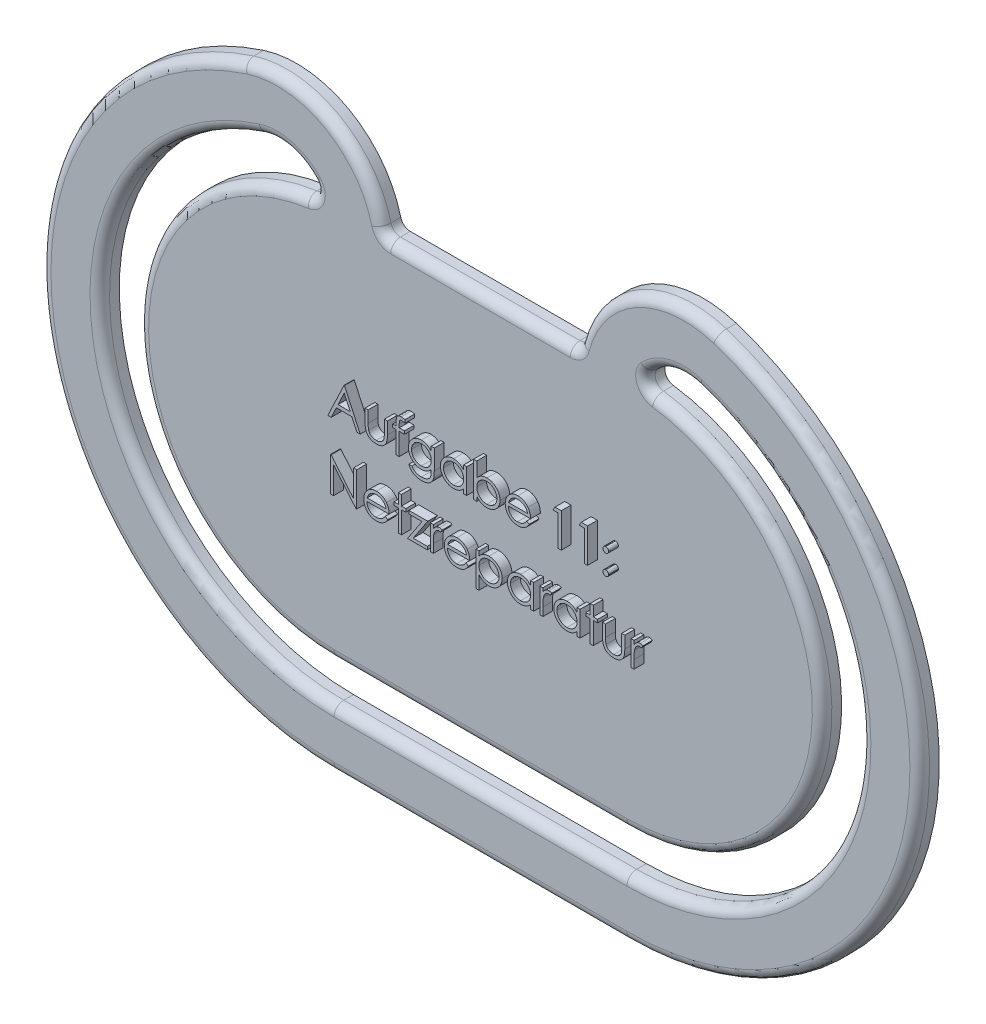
from build123d import *

# Parameters (mm, degrees)
AUFSATZ_LINEAR_AUSTRAGEN1_DEPTH = 2
VERRUNDUNG1_R                   = 1
VERRUNDUNG2_R                   = 1
AUFSATZ_LINEAR_AUSTRAGEN2_DEPTH = 1


with BuildPart() as part:
    # Skizze1 → Aufsatz-Linear austragen1 (new body)
    with BuildSketch(Plane.XY):
        with BuildLine():
            Line((-10, 20), (10, 20))
            ThreePointArc((10, 20), (15.158921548, 27.507354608), (24.207878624, 28.551969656))
            ThreePointArc((24.207878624, 28.551969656), (44.635781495, -4.660520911), (15, -30))
            Line((15, -30), (-15, -30))
            ThreePointArc((-15, -30), (-44.635781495, -4.660520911), (-24.207878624, 28.551969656))
            ThreePointArc((-24.207878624, 28.551969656), (-15.158921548, 27.507354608), (-10, 20))
        make_face()
        with BuildLine():
            Line((-15, -20), (15, -20))
            ThreePointArc((15, -20), (34.991004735, -0.599774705), (16.199009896, 19.96402703))
            ThreePointArc((16.199009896, 19.96402703), (18.717543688, 22.613976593), (22.366302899, 22.841575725))
            ThreePointArc((22.366302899, 22.841575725), (38.708625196, -3.728416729), (15, -24))
            Line((15, -24), (-15, -24))
            ThreePointArc((-15, -24), (-38.708625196, -3.728416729), (-22.366302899, 22.841575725))
            ThreePointArc((-22.366302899, 22.841575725), (-18.717543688, 22.613976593), (-16.199009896, 19.96402703))
            ThreePointArc((-16.199009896, 19.96402703), (-34.991004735, -0.599774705), (-15, -20))
        make_face(mode=Mode.SUBTRACT)
    extrude(amount=AUFSATZ_LINEAR_AUSTRAGEN1_DEPTH)

    # Verrundung1
    verrundung1_edges = [part.edges().sort_by_distance(p)[0] for p in [
        (-10, 20, 1),
        (10, 20, 1),
        (-16.199009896, 19.96402703, 1),
        (16.199009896, 19.96402703, 1),
    ]]
    fillet(verrundung1_edges, radius=VERRUNDUNG1_R)

    # Verrundung2
    verrundung2_edges = [part.edges().sort_by_distance(p)[0] for p in [
        (44.635781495, -4.660520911, 2),
        (15.493989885, 27.701090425, 2),
        (-38.708625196, -3.728416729, 2),
        (0, -24, 2),
        (38.708625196, -3.728416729, 2),
        (19.564960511, 22.919801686, 2),
        (0, -20, 2),
        (-34.952184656, -1.382145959, 2),
        (-44.635781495, -4.660520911, 2),
        (-19.564960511, 22.919801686, 2),
        (34.952184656, -1.382145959, 2),
        (-15.493989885, 27.701090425, 2),
        (0, 20, 2),
        (-16.953800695, 20.463148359, 2),
        (16.953800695, 20.463148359, 2),
        (-9.806799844, 20.211618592, 2),
        (9.806799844, 20.211618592, 2),
        (0, -30, 2),
    ]]
    fillet(verrundung2_edges, radius=VERRUNDUNG2_R)

    # Skizze2 → Aufsatz-Linear austragen2 (add)
    # profile 1 of 24: a face of its own
    with BuildSketch(Plane.XY.offset(2)):
        Polygon((-12.930559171, 5.950169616), (-11.315174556, 2.450169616), (-11.65662087, 2.450169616), (-12.174048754, 3.571964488), (-13.760687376, 3.571964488), (-14.292838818, 2.450169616), (-14.635687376, 2.450169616), (-12.975430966, 5.950169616), align=None)
        Polygon((-12.956500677, 5.26797811), (-13.59031478, 3.930938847), (-12.339513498, 3.930938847), align=None, mode=Mode.SUBTRACT)
    # profile 2 of 24: a face of its own
    with BuildSketch(Plane.XY.offset(2)):
        with BuildLine():
            Line((-10.821584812, 5.007861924), (-10.507482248, 5.007861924))
            Line((-10.507482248, 5.007861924), (-10.507482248, 3.821563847))
            add(Edge.make_bspline(
                [(-10.507482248, 3.821563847), (-10.507340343, 3.786741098), (-10.507068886, 3.72012681), (-10.505227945, 3.624271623), (-10.500897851, 3.53685491), (-10.495484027, 3.457826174), (-10.48852189, 3.387198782), (-10.48023853, 3.325219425), (-10.470980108, 3.271185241), (-10.461917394, 3.238641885), (-10.4577026, 3.223506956)],
                knots=[0, 0, 0, 0, 1.388932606, 2.656963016, 3.823490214, 4.879454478, 5.816252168, 6.653371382, 7.373723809, 8, 8, 8, 8], degree=3))
            add(Edge.make_bspline(
                [(-10.4577026, 3.223506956), (-10.450941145, 3.204484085), (-10.437558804, 3.166833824), (-10.413285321, 3.112444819), (-10.383256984, 3.062069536), (-10.350397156, 3.013765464), (-10.312497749, 2.968963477), (-10.270038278, 2.927739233), (-10.224440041, 2.888535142), (-10.156685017, 2.84215035), (-10.064025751, 2.79243502), (-9.942372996, 2.749539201), (-9.81046877, 2.723903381), (-9.719304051, 2.720929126), (-9.67244619, 2.719400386)],
                knots=[0, 0, 0, 0, 0.725840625, 1.436591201, 2.137033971, 2.831655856, 3.53531722, 4.242432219, 4.957935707, 5.694543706, 7.190802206, 8.724350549, 10.316345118, 12, 12, 12, 12], degree=3))
            add(Edge.make_bspline(
                [(-9.67244619, 2.719400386), (-9.625592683, 2.720961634), (-9.534939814, 2.723982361), (-9.404484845, 2.7487659), (-9.285233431, 2.790171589), (-9.178382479, 2.847979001), (-9.084416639, 2.918721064), (-9.00611222, 3.001729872), (-8.941504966, 3.094379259), (-8.913295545, 3.163503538), (-8.89910885, 3.198266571)],
                knots=[0, 0, 0, 0, 1.157059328, 2.238695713, 3.266970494, 4.264342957, 5.228770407, 6.160125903, 7.074715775, 8, 8, 8, 8], degree=3))
            add(Edge.make_bspline(
                [(-8.89910885, 3.198266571), (-8.89491462, 3.21223287), (-8.885642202, 3.243108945), (-8.875679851, 3.295488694), (-8.866705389, 3.357953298), (-8.859042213, 3.430911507), (-8.85357705, 3.51417266), (-8.850631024, 3.607710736), (-8.847302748, 3.711232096), (-8.847252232, 3.783699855), (-8.847225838, 3.821563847)],
                knots=[0, 0, 0, 0, 0.557542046, 1.232589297, 2.036731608, 2.971723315, 4.038036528, 5.22795436, 6.551621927, 8, 8, 8, 8], degree=3))
            Line((-8.847225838, 3.821563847), (-8.847225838, 5.007861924))
            Line((-8.847225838, 5.007861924), (-8.533123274, 5.007861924))
            Line((-8.533123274, 5.007861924), (-8.533123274, 3.762669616))
            add(Edge.make_bspline(
                [(-8.533123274, 3.762669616), (-8.533564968, 3.720362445), (-8.534421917, 3.638280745), (-8.53992926, 3.518996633), (-8.549378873, 3.407834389), (-8.563721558, 3.304735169), (-8.580587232, 3.209777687), (-8.602343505, 3.122840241), (-8.628321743, 3.044190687), (-8.657627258, 2.97244891), (-8.692249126, 2.907402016), (-8.729076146, 2.845666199), (-8.771600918, 2.788773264), (-8.816371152, 2.733891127), (-8.866172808, 2.6837496), (-8.920072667, 2.637198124), (-8.977312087, 2.593525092), (-9.039161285, 2.554433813), (-9.104717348, 2.519217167), (-9.174061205, 2.488001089), (-9.248042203, 2.463298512), (-9.32570584, 2.441987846), (-9.407432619, 2.425273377), (-9.493143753, 2.41348681), (-9.582810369, 2.406261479), (-9.643919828, 2.405624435), (-9.675250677, 2.405297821)],
                knots=[0, 0, 0, 0, 1.493040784, 2.896703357, 4.213163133, 5.428574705, 6.569057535, 7.615249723, 8.588095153, 9.490268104, 10.346124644, 11.18633936, 12.024365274, 12.850166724, 13.684164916, 14.514361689, 15.362232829, 16.222528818, 17.093394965, 17.986930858, 18.902426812, 19.842810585, 20.827885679, 21.843828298, 22.894529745, 24, 24, 24, 24], degree=3))
            add(Edge.make_bspline(
                [(-9.675250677, 2.405297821), (-9.706347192, 2.405637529), (-9.767454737, 2.406305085), (-9.857125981, 2.413446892), (-9.943074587, 2.425255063), (-10.024994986, 2.44211028), (-10.102969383, 2.46314935), (-10.177313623, 2.488152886), (-10.247157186, 2.519233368), (-10.31333919, 2.554210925), (-10.375341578, 2.5937762), (-10.433450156, 2.63714424), (-10.487587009, 2.684250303), (-10.537764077, 2.73489766), (-10.583277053, 2.789714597), (-10.624693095, 2.848260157), (-10.6626498, 2.909954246), (-10.69700259, 2.976017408), (-10.726514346, 3.048589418), (-10.752569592, 3.128886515), (-10.77388023, 3.217789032), (-10.791222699, 3.31522096), (-10.805174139, 3.420716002), (-10.814860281, 3.534884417), (-10.820276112, 3.657448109), (-10.821139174, 3.742097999), (-10.821584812, 3.785806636)],
                knots=[0, 0, 0, 0, 1.083640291, 2.129454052, 3.13281866, 4.105697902, 5.042300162, 5.946461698, 6.836384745, 7.703652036, 8.553297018, 9.397182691, 10.228592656, 11.052265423, 11.879314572, 12.708807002, 13.549817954, 14.402308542, 15.300838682, 16.27712199, 17.341985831, 18.484375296, 19.725102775, 21.0496083, 22.476576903, 24, 24, 24, 24], degree=3))
            Line((-10.821584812, 3.785806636), (-10.821584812, 5.007861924))
        make_face()
    # profile 3 of 24: a face of its own
    with BuildSketch(Plane.XY.offset(2)):
        with BuildLine():
            Line((-6.738251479, 6.018879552), (-6.738251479, 5.692156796))
            add(Edge.make_bspline(
                [(-6.738251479, 5.692156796), (-6.767990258, 5.704107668), (-6.824435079, 5.726790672), (-6.907675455, 5.751455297), (-6.984204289, 5.767391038), (-7.033358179, 5.769626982), (-7.056560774, 5.770682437)],
                knots=[0, 0, 0, 0, 1.16548392, 2.212112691, 3.15604595, 4, 4, 4, 4], degree=3))
            add(Edge.make_bspline(
                [(-7.056560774, 5.770682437), (-7.072234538, 5.770031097), (-7.102573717, 5.768770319), (-7.146177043, 5.762342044), (-7.185466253, 5.749239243), (-7.220371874, 5.732209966), (-7.249322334, 5.710855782), (-7.274108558, 5.689400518), (-7.292075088, 5.665215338), (-7.301830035, 5.642694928), (-7.307780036, 5.621843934), (-7.309570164, 5.600489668), (-7.313955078, 5.574265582), (-7.315177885, 5.542101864), (-7.317965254, 5.504999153), (-7.317718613, 5.462172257), (-7.320002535, 5.414295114), (-7.319660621, 5.380394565), (-7.319481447, 5.362629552)],
                knots=[0, 0, 0, 0, 1.311993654, 2.539582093, 3.670788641, 4.763509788, 5.772417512, 6.671800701, 7.496729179, 8.266799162, 8.712543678, 9.304149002, 10.05334463, 10.934920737, 11.99209668, 13.165090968, 14.514413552, 16, 16, 16, 16], degree=3))
            Line((-7.319481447, 5.362629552), (-7.319481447, 5.007861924))
            Line((-7.319481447, 5.007861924), (-6.783123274, 5.007861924))
            Line((-6.783123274, 5.007861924), (-6.783123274, 4.69375936))
            Line((-6.783123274, 4.69375936), (-7.320182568, 4.69375936))
            Line((-7.320182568, 4.69375936), (-7.321584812, 2.450169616))
            Line((-7.321584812, 2.450169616), (-7.635687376, 2.450169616))
            Line((-7.635687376, 2.450169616), (-7.635687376, 4.69375936))
            Line((-7.635687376, 4.69375936), (-7.994661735, 4.69375936))
            Line((-7.994661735, 4.69375936), (-7.994661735, 5.007861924))
            Line((-7.994661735, 5.007861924), (-7.635687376, 5.007861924))
            Line((-7.635687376, 5.007861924), (-7.635687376, 5.41661593))
            add(Edge.make_bspline(
                [(-7.635687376, 5.41661593), (-7.635662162, 5.43929151), (-7.63561379, 5.482792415), (-7.632225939, 5.545401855), (-7.629330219, 5.603225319), (-7.623562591, 5.655813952), (-7.616900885, 5.703660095), (-7.607364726, 5.746052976), (-7.598353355, 5.784134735), (-7.582004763, 5.827237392), (-7.557582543, 5.876087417), (-7.518052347, 5.927711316), (-7.470659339, 5.974016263), (-7.414051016, 6.013023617), (-7.350335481, 6.045439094), (-7.279454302, 6.068680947), (-7.202179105, 6.081821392), (-7.148691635, 6.083775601), (-7.121063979, 6.084785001)],
                knots=[0, 0, 0, 0, 1.116398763, 2.141702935, 3.087165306, 3.966655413, 4.746276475, 5.464069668, 6.106083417, 6.67047701, 7.730773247, 8.782666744, 9.856985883, 10.980834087, 12.154321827, 13.366232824, 14.639591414, 16, 16, 16, 16], degree=3))
            add(Edge.make_bspline(
                [(-7.121063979, 6.084785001), (-7.092987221, 6.08382762), (-7.034041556, 6.08181765), (-6.941844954, 6.069384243), (-6.842248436, 6.047913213), (-6.773912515, 6.028835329), (-6.738251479, 6.018879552)],
                knots=[0, 0, 0, 0, 0.864728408, 1.815451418, 2.859995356, 4, 4, 4, 4], degree=3))
        make_face()
    # profile 4 of 24: a face of its own
    with BuildSketch(Plane.XY.offset(2)):
        with BuildLine():
            Line((-4.045943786, 5.007861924), (-3.731841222, 5.007861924))
            Line((-3.731841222, 5.007861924), (-3.731841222, 2.978114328))
            add(Edge.make_bspline(
                [(-3.731841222, 2.978114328), (-3.732118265, 2.934876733), (-3.732653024, 2.851417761), (-3.736503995, 2.730739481), (-3.744624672, 2.619273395), (-3.753833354, 2.516511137), (-3.76708007, 2.422929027), (-3.783256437, 2.338247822), (-3.801492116, 2.26238626), (-3.817512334, 2.215661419), (-3.825090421, 2.193559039)],
                knots=[0, 0, 0, 0, 1.307562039, 2.523909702, 3.650326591, 4.686913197, 5.643429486, 6.506965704, 7.293745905, 8, 8, 8, 8], degree=3))
            add(Edge.make_bspline(
                [(-3.825090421, 2.193559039), (-3.83627966, 2.164829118), (-3.858323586, 2.108228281), (-3.89960922, 2.02799396), (-3.945843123, 1.95244757), (-3.998649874, 1.882010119), (-4.057790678, 1.817035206), (-4.12187217, 1.756111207), (-4.192142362, 1.70052704), (-4.268561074, 1.651241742), (-4.349366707, 1.606854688), (-4.434512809, 1.568408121), (-4.523519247, 1.534921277), (-4.617222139, 1.509838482), (-4.714152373, 1.488103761), (-4.815449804, 1.473959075), (-4.920522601, 1.464332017), (-4.991967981, 1.463441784), (-5.028215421, 1.462990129)],
                knots=[0, 0, 0, 0, 0.981931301, 1.934503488, 2.87077864, 3.801706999, 4.735015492, 5.667491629, 6.616593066, 7.585388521, 8.561939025, 9.551802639, 10.560317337, 11.588439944, 12.640189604, 13.723962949, 14.845264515, 16, 16, 16, 16], degree=3))
            add(Edge.make_bspline(
                [(-5.028215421, 1.462990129), (-5.081100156, 1.463846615), (-5.184398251, 1.465519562), (-5.335003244, 1.485010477), (-5.478037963, 1.51256485), (-5.61161242, 1.554270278), (-5.734882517, 1.605307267), (-5.847006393, 1.66390222), (-5.9469775, 1.731091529), (-6.037101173, 1.80759213), (-6.118442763, 1.898555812), (-6.194970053, 2.005754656), (-6.268630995, 2.130821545), (-6.311799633, 2.222614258), (-6.334405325, 2.270682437)],
                knots=[0, 0, 0, 0, 1.157897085, 2.2616841, 3.32207898, 4.345638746, 5.321241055, 6.241986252, 7.112515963, 7.955008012, 8.825025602, 9.77857164, 10.836726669, 12, 12, 12, 12], degree=3))
            Line((-6.334405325, 2.270682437), (-6.020302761, 2.270682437))
            add(Edge.make_bspline(
                [(-6.020302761, 2.270682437), (-5.995040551, 2.230576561), (-5.945656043, 2.152174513), (-5.853307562, 2.050661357), (-5.752101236, 1.963907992), (-5.638621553, 1.893997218), (-5.512396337, 1.841287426), (-5.373349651, 1.80371213), (-5.220350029, 1.781215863), (-5.113831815, 1.778504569), (-5.058363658, 1.777092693)],
                knots=[0, 0, 0, 0, 0.997731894, 1.950442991, 2.880492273, 3.800895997, 4.748200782, 5.754801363, 6.83083817, 8, 8, 8, 8], degree=3))
            add(Edge.make_bspline(
                [(-5.058363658, 1.777092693), (-5.003596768, 1.778522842), (-4.898011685, 1.781280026), (-4.746180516, 1.80372217), (-4.607585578, 1.841295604), (-4.483025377, 1.89390399), (-4.373969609, 1.958354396), (-4.279957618, 2.030354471), (-4.203812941, 2.111535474), (-4.152599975, 2.18631728), (-4.120765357, 2.25294141), (-4.10049312, 2.310294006), (-4.084019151, 2.375146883), (-4.070239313, 2.447282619), (-4.0588684, 2.526804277), (-4.051665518, 2.61389368), (-4.046459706, 2.708352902), (-4.046119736, 2.77384604), (-4.045943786, 2.807741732)],
                knots=[0, 0, 0, 0, 1.570740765, 3.028230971, 4.391408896, 5.680370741, 6.894727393, 8.017376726, 9.065722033, 10.075533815, 10.603371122, 11.180248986, 11.817768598, 12.521299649, 13.286540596, 14.121245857, 15.027658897, 16, 16, 16, 16], degree=3))
            Line((-4.045943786, 2.807741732), (-4.045943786, 2.940253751))
            add(Edge.make_bspline(
                [(-4.045943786, 2.940253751), (-4.077824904, 2.902311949), (-4.14102636, 2.827095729), (-4.250173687, 2.728534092), (-4.369390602, 2.643647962), (-4.498474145, 2.574029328), (-4.634262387, 2.518347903), (-4.775284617, 2.479404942), (-4.920276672, 2.454245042), (-5.018528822, 2.451537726), (-5.068179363, 2.450169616)],
                knots=[0, 0, 0, 0, 1.012485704, 2.007162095, 2.997754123, 3.998611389, 4.999708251, 5.992315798, 6.98544096, 8, 8, 8, 8], degree=3))
            add(Edge.make_bspline(
                [(-5.068179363, 2.450169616), (-5.097415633, 2.450684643), (-5.15554219, 2.451708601), (-5.241896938, 2.460667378), (-5.326977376, 2.473666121), (-5.410585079, 2.49274756), (-5.492840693, 2.517239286), (-5.573608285, 2.547856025), (-5.653541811, 2.582471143), (-5.731188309, 2.623243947), (-5.80577444, 2.668606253), (-5.876737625, 2.717745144), (-5.943706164, 2.770403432), (-6.006042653, 2.827100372), (-6.063665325, 2.887753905), (-6.117349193, 2.951717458), (-6.16620654, 3.019884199), (-6.211239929, 3.091011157), (-6.25029748, 3.165572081), (-6.284581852, 3.241950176), (-6.314391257, 3.319982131), (-6.338156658, 3.399929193), (-6.356307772, 3.481740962), (-6.369817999, 3.565283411), (-6.37748093, 3.650813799), (-6.378675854, 3.708435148), (-6.37927712, 3.737429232)],
                knots=[0, 0, 0, 0, 1.028754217, 2.045334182, 3.052854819, 4.056607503, 5.061168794, 6.071104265, 7.095078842, 8.125279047, 9.155117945, 10.165957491, 11.161587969, 12.151493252, 13.128948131, 14.104219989, 15.088194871, 16.07871515, 17.064853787, 18.047899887, 19.02414258, 20.002704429, 20.980574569, 21.971845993, 22.979467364, 24, 24, 24, 24], degree=3))
            add(Edge.make_bspline(
                [(-6.37927712, 3.737429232), (-6.378757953, 3.766432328), (-6.377721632, 3.824326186), (-6.368770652, 3.910205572), (-6.356002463, 3.994935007), (-6.335794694, 4.077641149), (-6.311472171, 4.159265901), (-6.281348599, 4.239206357), (-6.24512984, 4.317486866), (-6.20412009, 4.394165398), (-6.158035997, 4.468213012), (-6.107503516, 4.538539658), (-6.052461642, 4.60462783), (-5.993669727, 4.667144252), (-5.930409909, 4.725485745), (-5.862714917, 4.77951071), (-5.791252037, 4.830124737), (-5.715799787, 4.876236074), (-5.637522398, 4.91701832), (-5.558408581, 4.954230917), (-5.477410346, 4.983765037), (-5.396037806, 5.009788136), (-5.312857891, 5.028223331), (-5.228890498, 5.042445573), (-5.14384816, 5.051110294), (-5.086895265, 5.052191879), (-5.058363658, 5.052733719)],
                knots=[0, 0, 0, 0, 1.008818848, 2.013730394, 3.001654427, 3.987803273, 4.973046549, 5.963777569, 6.957074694, 7.972068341, 8.987420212, 9.989399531, 10.982630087, 11.977756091, 12.973280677, 13.973972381, 14.989194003, 16.018387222, 17.047741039, 18.059210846, 19.057554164, 20.045176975, 21.029480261, 22.018708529, 23.007435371, 24, 24, 24, 24], degree=3))
            add(Edge.make_bspline(
                [(-5.058363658, 5.052733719), (-5.011312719, 5.051377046), (-4.918401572, 5.048698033), (-4.781670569, 5.027676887), (-4.649728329, 4.994162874), (-4.521830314, 4.946147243), (-4.396934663, 4.880597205), (-4.275453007, 4.794254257), (-4.157033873, 4.686343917), (-4.083956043, 4.603591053), (-4.045943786, 4.560546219)],
                knots=[0, 0, 0, 0, 0.96728863, 1.910097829, 2.838038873, 3.762875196, 4.71315279, 5.730631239, 6.819562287, 8, 8, 8, 8], degree=3))
            Line((-4.045943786, 4.560546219), (-4.045943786, 5.007861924))
        make_face()
        with BuildLine():
            add(Edge.make_bspline(
                [(-5.033123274, 4.738631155), (-5.079053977, 4.737070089), (-5.169987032, 4.733979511), (-5.303275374, 4.707594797), (-5.431952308, 4.666248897), (-5.553557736, 4.607106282), (-5.667464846, 4.535012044), (-5.768539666, 4.447671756), (-5.856944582, 4.34792556), (-5.931727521, 4.236675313), (-5.991258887, 4.116653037), (-6.033402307, 3.990142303), (-6.06065233, 3.85918731), (-6.063659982, 3.769814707), (-6.065174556, 3.724809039)],
                knots=[0, 0, 0, 0, 1.026226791, 2.031711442, 3.026614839, 4.04107745, 5.047145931, 6.032893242, 7.017642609, 8.019221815, 9.021877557, 10.003543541, 10.994637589, 12, 12, 12, 12], degree=3))
            add(Edge.make_bspline(
                [(-6.065174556, 3.724809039), (-6.064448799, 3.690875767), (-6.063021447, 3.624138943), (-6.04929787, 3.526201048), (-6.027116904, 3.432920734), (-5.995679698, 3.34429236), (-5.956727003, 3.259807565), (-5.907734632, 3.18004833), (-5.850083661, 3.104943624), (-5.784225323, 3.035048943), (-5.711648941, 2.971387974), (-5.632929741, 2.915449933), (-5.548174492, 2.869699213), (-5.459467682, 2.830158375), (-5.364656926, 2.801279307), (-5.26510784, 2.779240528), (-5.160116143, 2.76663177), (-5.088544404, 2.765068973), (-5.052053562, 2.76427218)],
                knots=[0, 0, 0, 0, 1.039728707, 2.044842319, 3.024901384, 3.974314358, 4.923051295, 5.871625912, 6.837440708, 7.820715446, 8.810779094, 9.792721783, 10.773906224, 11.758876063, 12.764959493, 13.806266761, 14.881525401, 16, 16, 16, 16], degree=3))
            add(Edge.make_bspline(
                [(-5.052053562, 2.76427218), (-5.015089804, 2.765039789), (-4.942807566, 2.766540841), (-4.83723663, 2.779444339), (-4.73720389, 2.800266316), (-4.642801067, 2.829829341), (-4.553671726, 2.867551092), (-4.470817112, 2.915287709), (-4.392460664, 2.969652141), (-4.321104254, 3.033064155), (-4.256580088, 3.10294915), (-4.200349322, 3.178994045), (-4.152434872, 3.260054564), (-4.112757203, 3.34612157), (-4.082465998, 3.437863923), (-4.062147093, 3.535052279), (-4.047940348, 3.637221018), (-4.046619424, 3.707229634), (-4.045943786, 3.743038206)],
                knots=[0, 0, 0, 0, 1.121943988, 2.193949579, 3.223793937, 4.220241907, 5.192961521, 6.155822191, 7.11847367, 8.083710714, 9.04790392, 10.001595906, 10.949595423, 11.902125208, 12.873731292, 13.87582262, 14.913508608, 16, 16, 16, 16], degree=3))
            add(Edge.make_bspline(
                [(-4.045943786, 3.743038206), (-4.047283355, 3.78965606), (-4.0499004, 3.880730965), (-4.074597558, 4.013437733), (-4.114417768, 4.138206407), (-4.17026452, 4.254642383), (-4.240246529, 4.361511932), (-4.324537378, 4.456835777), (-4.421683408, 4.540736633), (-4.531405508, 4.610634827), (-4.649452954, 4.667100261), (-4.77297415, 4.709462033), (-4.901785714, 4.733456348), (-4.989092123, 4.736896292), (-5.033123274, 4.738631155)],
                knots=[0, 0, 0, 0, 1.070913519, 2.092188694, 3.091357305, 4.074328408, 5.051968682, 6.018948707, 6.99050112, 7.9935919, 9.000589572, 9.992915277, 10.987769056, 12, 12, 12, 12], degree=3))
        make_face(mode=Mode.SUBTRACT)
    # profile 5 of 24: a face of its own
    with BuildSketch(Plane.XY.offset(2)):
        with BuildLine():
            Line((-0.411328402, 5.007861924), (-0.411328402, 2.450169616))
            Line((-0.411328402, 2.450169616), (-0.725430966, 2.450169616))
            Line((-0.725430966, 2.450169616), (-0.725430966, 2.892577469))
            add(Edge.make_bspline(
                [(-0.725430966, 2.892577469), (-0.760849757, 2.852537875), (-0.829969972, 2.774400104), (-0.94541109, 2.672317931), (-1.067779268, 2.58793961), (-1.196480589, 2.519789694), (-1.331398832, 2.468597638), (-1.472234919, 2.432211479), (-1.6190463, 2.408817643), (-1.719298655, 2.406481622), (-1.77010244, 2.405297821)],
                knots=[0, 0, 0, 0, 1.074387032, 2.096679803, 3.090159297, 4.057316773, 5.018401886, 5.985159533, 6.978961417, 8, 8, 8, 8], degree=3))
            add(Edge.make_bspline(
                [(-1.77010244, 2.405297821), (-1.815270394, 2.406524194), (-1.904343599, 2.408942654), (-2.035372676, 2.427704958), (-2.161464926, 2.457835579), (-2.282739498, 2.499736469), (-2.398411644, 2.55531729), (-2.50947174, 2.621858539), (-2.615344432, 2.701099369), (-2.714415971, 2.791687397), (-2.805647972, 2.890082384), (-2.885709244, 2.995027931), (-2.952462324, 3.106070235), (-3.008282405, 3.221803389), (-3.051278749, 3.343118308), (-3.081252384, 3.469595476), (-3.09999283, 3.60108535), (-3.102410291, 3.690624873), (-3.103636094, 3.736026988)],
                knots=[0, 0, 0, 0, 1.033919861, 2.038935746, 3.024066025, 3.998881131, 4.97069526, 5.957263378, 6.95902576, 7.993208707, 9.027059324, 10.027763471, 11.009749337, 11.988697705, 12.965288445, 13.950418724, 14.960734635, 16, 16, 16, 16], degree=3))
            add(Edge.make_bspline(
                [(-3.103636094, 3.736026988), (-3.102383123, 3.780490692), (-3.099906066, 3.868393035), (-3.081452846, 3.997671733), (-3.050421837, 4.122189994), (-3.00687399, 4.241546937), (-2.951032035, 4.355886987), (-2.883103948, 4.465291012), (-2.803084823, 4.57006041), (-2.710832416, 4.667731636), (-2.610897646, 4.757952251), (-2.503988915, 4.836361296), (-2.392765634, 4.904078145), (-2.275502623, 4.957731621), (-2.153935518, 5.001140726), (-2.026982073, 5.031173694), (-1.895170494, 5.048871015), (-1.805680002, 5.051433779), (-1.760286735, 5.052733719)],
                knots=[0, 0, 0, 0, 1.020392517, 2.01726096, 2.990465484, 3.961182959, 4.928053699, 5.906110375, 6.912531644, 7.948652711, 8.985773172, 9.998621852, 10.987621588, 11.969261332, 12.953316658, 13.946091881, 14.958173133, 16, 16, 16, 16], degree=3))
            add(Edge.make_bspline(
                [(-1.760286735, 5.052733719), (-1.708086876, 5.051295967), (-1.605725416, 5.048476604), (-1.455997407, 5.025013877), (-1.314352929, 4.98537541), (-1.179698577, 4.931457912), (-1.052517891, 4.859809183), (-0.934014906, 4.769429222), (-0.822949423, 4.660888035), (-0.758569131, 4.57751759), (-0.725430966, 4.534604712)],
                knots=[0, 0, 0, 0, 1.038897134, 2.037228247, 3.008116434, 3.962042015, 4.918381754, 5.904844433, 6.921570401, 8, 8, 8, 8], degree=3))
            Line((-0.725430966, 4.534604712), (-0.725430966, 5.007861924))
            Line((-0.725430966, 5.007861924), (-0.411328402, 5.007861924))
        make_face()
        with BuildLine():
            add(Edge.make_bspline(
                [(-1.756080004, 4.738631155), (-1.801994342, 4.736997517), (-1.892621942, 4.733772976), (-2.025665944, 4.708599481), (-2.152979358, 4.666714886), (-2.273925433, 4.609432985), (-2.386593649, 4.537404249), (-2.48728732, 4.450282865), (-2.576830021, 4.350445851), (-2.652138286, 4.238343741), (-2.713528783, 4.11816565), (-2.756695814, 3.992541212), (-2.785165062, 3.863736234), (-2.788073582, 3.776373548), (-2.78953353, 3.732521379)],
                knots=[0, 0, 0, 0, 1.031046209, 2.035121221, 3.029706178, 4.034933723, 5.034054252, 6.02443088, 7.017295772, 8.038157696, 9.050218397, 10.03989886, 11.016116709, 12, 12, 12, 12], degree=3))
            add(Edge.make_bspline(
                [(-2.78953353, 3.732521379), (-2.787668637, 3.688931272), (-2.78394616, 3.601921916), (-2.757195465, 3.472941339), (-2.712315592, 3.347287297), (-2.651073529, 3.226026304), (-2.574386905, 3.113442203), (-2.485498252, 3.011702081), (-2.383547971, 2.924212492), (-2.270620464, 2.850974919), (-2.150012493, 2.791812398), (-2.023178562, 2.750646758), (-1.892502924, 2.724068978), (-1.80365059, 2.720964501), (-1.758884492, 2.719400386)],
                knots=[0, 0, 0, 0, 0.979072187, 1.954306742, 2.945804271, 3.96968567, 4.997920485, 5.998718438, 6.996577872, 8.005894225, 9.015743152, 10.005417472, 10.995077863, 12, 12, 12, 12], degree=3))
            add(Edge.make_bspline(
                [(-1.758884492, 2.719400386), (-1.713437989, 2.721060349), (-1.623049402, 2.724361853), (-1.489610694, 2.749643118), (-1.360115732, 2.791411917), (-1.236328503, 2.849311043), (-1.121012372, 2.921068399), (-1.017514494, 3.00507549), (-0.929998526, 3.102778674), (-0.855805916, 3.210155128), (-0.7976305, 3.327867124), (-0.755254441, 3.453201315), (-0.730200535, 3.586162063), (-0.727042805, 3.67702599), (-0.725430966, 3.723406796)],
                knots=[0, 0, 0, 0, 1.01762866, 2.023962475, 3.030623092, 4.058876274, 5.077231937, 6.066672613, 7.034107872, 8.005628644, 8.981990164, 9.965428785, 10.961468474, 12, 12, 12, 12], degree=3))
            add(Edge.make_bspline(
                [(-0.725430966, 3.723406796), (-0.726390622, 3.758744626), (-0.72827953, 3.82830066), (-0.742710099, 3.930428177), (-0.765665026, 4.028161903), (-0.798011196, 4.121604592), (-0.84050248, 4.210239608), (-0.891750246, 4.294703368), (-0.952655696, 4.374556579), (-1.022238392, 4.44869965), (-1.098403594, 4.516326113), (-1.178998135, 4.576690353), (-1.264976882, 4.626279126), (-1.354893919, 4.667320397), (-1.448905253, 4.699979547), (-1.547775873, 4.721767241), (-1.65045486, 4.736727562), (-1.720500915, 4.737989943), (-1.756080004, 4.738631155)],
                knots=[0, 0, 0, 0, 1.050140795, 2.067009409, 3.05949893, 4.030605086, 5.00011959, 5.97591094, 6.962425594, 7.979863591, 8.993523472, 9.986985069, 10.967611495, 11.937549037, 12.921786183, 13.919465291, 14.943216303, 16, 16, 16, 16], degree=3))
        make_face(mode=Mode.SUBTRACT)
    # profile 6 of 24: a face of its own
    with BuildSketch(Plane.XY.offset(2)):
        with BuildLine():
            Line((0.306620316, 2.450169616), (0.306620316, 6.039913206))
            Line((0.306620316, 6.039913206), (0.62072288, 6.039913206))
            Line((0.62072288, 6.039913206), (0.62072288, 4.543719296))
            add(Edge.make_bspline(
                [(0.62072288, 4.543719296), (0.656116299, 4.584477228), (0.725170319, 4.663997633), (0.84094677, 4.767845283), (0.96235234, 4.85589776), (1.090310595, 4.928483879), (1.225003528, 4.983757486), (1.365735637, 5.024179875), (1.512866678, 5.048566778), (1.613185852, 5.051332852), (1.663992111, 5.052733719)],
                knots=[0, 0, 0, 0, 1.077089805, 2.101446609, 3.097517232, 4.067117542, 5.031729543, 5.997785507, 6.985986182, 8, 8, 8, 8], degree=3))
            add(Edge.make_bspline(
                [(1.663992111, 5.052733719), (1.709158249, 5.051493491), (1.798459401, 5.049041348), (1.929741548, 5.030406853), (2.056054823, 5.000189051), (2.177330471, 4.958296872), (2.293002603, 4.902713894), (2.40406166, 4.836172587), (2.509938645, 4.756934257), (2.60899353, 4.666335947), (2.700287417, 4.567979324), (2.780199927, 4.462799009), (2.847699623, 4.352323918), (2.903530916, 4.236923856), (2.946701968, 4.116127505), (2.976444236, 3.990053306), (2.9953377, 3.858825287), (2.997717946, 3.769512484), (2.998928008, 3.724107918)],
                knots=[0, 0, 0, 0, 1.034377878, 2.045141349, 3.03070803, 4.00595497, 4.978199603, 5.965204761, 6.967410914, 8.002051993, 9.036360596, 10.037508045, 11.022711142, 11.997267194, 12.969246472, 13.954813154, 14.960274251, 16, 16, 16, 16], degree=3))
            add(Edge.make_bspline(
                [(2.998928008, 3.724107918), (2.997691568, 3.6794079), (2.995253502, 3.591266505), (2.976632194, 3.461559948), (2.945885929, 3.336721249), (2.901924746, 3.217072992), (2.846659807, 3.102053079), (2.777548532, 2.992972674), (2.697737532, 2.887933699), (2.605406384, 2.790310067), (2.505492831, 2.700076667), (2.398578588, 2.621670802), (2.287356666, 2.553953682), (2.170093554, 2.500298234), (2.048525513, 2.456897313), (1.921350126, 2.426779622), (1.789286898, 2.409206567), (1.699568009, 2.406611), (1.654176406, 2.405297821)],
                knots=[0, 0, 0, 0, 1.024244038, 2.01964794, 2.996620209, 3.965911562, 4.936179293, 5.91563013, 6.920572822, 7.955171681, 8.990768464, 10.002129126, 10.989675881, 11.969873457, 12.952483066, 13.943799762, 14.959703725, 16, 16, 16, 16], degree=3))
            add(Edge.make_bspline(
                [(1.654176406, 2.405297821), (1.602211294, 2.40673843), (1.500316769, 2.409563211), (1.351264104, 2.43298219), (1.210182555, 2.472843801), (1.075465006, 2.526405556), (0.949037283, 2.59893421), (0.830096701, 2.688890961), (0.719393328, 2.797758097), (0.654176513, 2.880819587), (0.62072288, 2.923426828)],
                knots=[0, 0, 0, 0, 1.035807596, 2.031038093, 2.998900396, 3.954262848, 4.914341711, 5.895762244, 6.92060972, 8, 8, 8, 8], degree=3))
            Line((0.62072288, 2.923426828), (0.62072288, 2.450169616))
            Line((0.62072288, 2.450169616), (0.306620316, 2.450169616))
        make_face()
        with BuildLine():
            add(Edge.make_bspline(
                [(1.651371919, 2.719400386), (1.697286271, 2.721034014), (1.7879139, 2.724258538), (1.92095769, 2.749432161), (2.0482719, 2.791316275), (2.169214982, 2.848599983), (2.281894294, 2.920622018), (2.382546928, 3.007768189), (2.472026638, 3.107269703), (2.546678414, 3.219503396), (2.609004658, 3.338954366), (2.651817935, 3.464608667), (2.680537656, 3.593103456), (2.683389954, 3.680249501), (2.684825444, 3.724107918)],
                knots=[0, 0, 0, 0, 1.031910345, 2.036826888, 3.032245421, 4.038315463, 5.03827337, 6.029480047, 7.023177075, 8.037597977, 9.052889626, 10.043399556, 11.015292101, 12, 12, 12, 12], degree=3))
            add(Edge.make_bspline(
                [(2.684825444, 3.724107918), (2.682937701, 3.767923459), (2.679169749, 3.85537962), (2.652794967, 3.985029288), (2.606737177, 4.110616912), (2.545619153, 4.231794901), (2.469751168, 4.344802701), (2.380745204, 4.446292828), (2.278863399, 4.533852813), (2.166039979, 4.606842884), (2.045859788, 4.666402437), (1.919369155, 4.707247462), (1.789211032, 4.733985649), (1.700815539, 4.737074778), (1.656279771, 4.738631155)],
                knots=[0, 0, 0, 0, 0.984795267, 1.965658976, 2.959410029, 3.983795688, 5.009594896, 6.01088574, 7.009236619, 8.019050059, 9.024672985, 10.014834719, 10.999826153, 12, 12, 12, 12], degree=3))
            add(Edge.make_bspline(
                [(1.656279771, 4.738631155), (1.610812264, 4.737075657), (1.520568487, 4.733988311), (1.387400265, 4.707200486), (1.257336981, 4.666152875), (1.133049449, 4.607221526), (1.017195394, 4.535110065), (0.913582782, 4.450369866), (0.824251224, 4.353589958), (0.750707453, 4.245084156), (0.692302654, 4.12789912), (0.650518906, 4.002886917), (0.62551926, 3.870705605), (0.622341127, 3.780072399), (0.62072288, 3.733923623)],
                knots=[0, 0, 0, 0, 1.016820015, 2.018181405, 3.029022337, 4.06341356, 5.088169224, 6.076823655, 7.05054209, 8.02560866, 9.001194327, 9.972267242, 10.967515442, 12, 12, 12, 12], degree=3))
            add(Edge.make_bspline(
                [(0.62072288, 3.733923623), (0.621682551, 3.698585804), (0.623571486, 3.629029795), (0.638001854, 3.526902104), (0.660957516, 3.429169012), (0.69330101, 3.335724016), (0.735802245, 3.247097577), (0.787012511, 3.162601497), (0.847964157, 3.082998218), (0.916870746, 3.008482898), (0.992833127, 2.940673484), (1.074356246, 2.881895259), (1.159774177, 2.831281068), (1.250064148, 2.790936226), (1.344175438, 2.758009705), (1.443073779, 2.736275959), (1.545745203, 2.721300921), (1.615792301, 2.720040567), (1.651371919, 2.719400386)],
                knots=[0, 0, 0, 0, 1.050331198, 2.067384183, 3.060053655, 4.031335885, 5.001026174, 5.976994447, 6.963687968, 7.976578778, 8.990422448, 9.985569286, 10.960374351, 11.936812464, 12.921228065, 13.919088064, 14.943024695, 16, 16, 16, 16], degree=3))
        make_face(mode=Mode.SUBTRACT)
    # profile 7 of 24: a face of its own
    with BuildSketch(Plane.XY.offset(2)):
        with BuildLine():
            Line((5.726291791, 3.257861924), (6.005338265, 3.111327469))
            add(Edge.make_bspline(
                [(6.005338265, 3.111327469), (5.98310167, 3.071884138), (5.939838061, 2.995143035), (5.865437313, 2.889711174), (5.787445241, 2.794863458), (5.702341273, 2.713133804), (5.612671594, 2.641882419), (5.517938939, 2.579544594), (5.417650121, 2.526426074), (5.311800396, 2.481673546), (5.199500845, 2.447264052), (5.080479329, 2.422959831), (4.954507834, 2.407936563), (4.868161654, 2.406191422), (4.823948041, 2.405297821)],
                knots=[0, 0, 0, 0, 1.120438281, 2.179929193, 3.190490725, 4.156257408, 5.095198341, 6.022838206, 6.959905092, 7.901321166, 8.864066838, 9.862729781, 10.905609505, 12, 12, 12, 12], degree=3))
            add(Edge.make_bspline(
                [(4.823948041, 2.405297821), (4.774806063, 2.406444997), (4.678944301, 2.408682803), (4.539404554, 2.427975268), (4.408025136, 2.459447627), (4.284813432, 2.503413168), (4.17007118, 2.560840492), (4.063570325, 2.630799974), (3.964750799, 2.712932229), (3.87672659, 2.807948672), (3.797482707, 2.909630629), (3.727556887, 3.015586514), (3.669099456, 3.125549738), (3.621546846, 3.238820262), (3.583141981, 3.354684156), (3.556375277, 3.474195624), (3.540945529, 3.597031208), (3.538581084, 3.680128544), (3.537389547, 3.722004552)],
                knots=[0, 0, 0, 0, 1.145258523, 2.234067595, 3.276747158, 4.290159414, 5.277019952, 6.260822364, 7.254936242, 8.264827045, 9.274100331, 10.257902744, 11.220704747, 12.172965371, 13.118907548, 14.062713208, 15.023725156, 16, 16, 16, 16], degree=3))
            add(Edge.make_bspline(
                [(3.537389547, 3.722004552), (3.538448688, 3.761299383), (3.540547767, 3.839176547), (3.553778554, 3.954442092), (3.577226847, 4.066470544), (3.609403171, 4.175354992), (3.650954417, 4.280913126), (3.701786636, 4.38320919), (3.761979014, 4.48213433), (3.808451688, 4.544537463), (3.831860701, 4.575970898)],
                knots=[0, 0, 0, 0, 1.024358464, 2.0301432, 3.019427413, 4.004406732, 4.986367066, 5.972626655, 6.978780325, 8, 8, 8, 8], degree=3))
            add(Edge.make_bspline(
                [(3.831860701, 4.575970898), (3.863568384, 4.613839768), (3.92597933, 4.688377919), (4.031535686, 4.786316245), (4.145835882, 4.86836002), (4.267447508, 4.936367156), (4.397783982, 4.988040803), (4.535093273, 5.026548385), (4.680938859, 5.048126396), (4.78064408, 5.05117423), (4.83166038, 5.052733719)],
                knots=[0, 0, 0, 0, 1.030682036, 2.02871468, 2.997146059, 3.962720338, 4.930598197, 5.918074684, 6.934738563, 8, 8, 8, 8], degree=3))
            add(Edge.make_bspline(
                [(4.83166038, 5.052733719), (4.884107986, 5.05137967), (4.986998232, 5.048723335), (5.137030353, 5.024097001), (5.278991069, 4.985044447), (5.412823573, 4.929890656), (5.538541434, 4.858731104), (5.655327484, 4.770589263), (5.765178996, 4.668171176), (5.829087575, 4.589407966), (5.861608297, 4.54932827)],
                knots=[0, 0, 0, 0, 1.056321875, 2.072262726, 3.055038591, 4.01806755, 4.982017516, 5.957941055, 6.960871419, 8, 8, 8, 8], degree=3))
            add(Edge.make_bspline(
                [(5.861608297, 4.54932827), (5.883735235, 4.519124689), (5.927841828, 4.45891857), (5.983088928, 4.360747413), (6.031046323, 4.258036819), (6.069379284, 4.149126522), (6.100418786, 4.035306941), (6.122875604, 3.915764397), (6.136045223, 3.790534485), (6.13863392, 3.70520793), (6.13995365, 3.661708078)],
                knots=[0, 0, 0, 0, 0.94817472, 1.890038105, 2.849395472, 3.817997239, 4.812318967, 5.836947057, 6.897266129, 8, 8, 8, 8], degree=3))
            Line((6.13995365, 3.661708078), (3.851492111, 3.661708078))
            add(Edge.make_bspline(
                [(3.851492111, 3.661708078), (3.853031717, 3.628007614), (3.856059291, 3.56173701), (3.870174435, 3.464766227), (3.892423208, 3.372392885), (3.923692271, 3.285309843), (3.961559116, 3.202379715), (4.007944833, 3.124217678), (4.063284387, 3.051179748), (4.125010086, 2.98261261), (4.193717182, 2.921551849), (4.265999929, 2.866900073), (4.342893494, 2.821094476), (4.423791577, 2.783914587), (4.508563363, 2.754808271), (4.597235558, 2.73494045), (4.689633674, 2.721633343), (4.752619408, 2.720153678), (4.78468522, 2.719400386)],
                knots=[0, 0, 0, 0, 1.094153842, 2.151609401, 3.174256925, 4.172055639, 5.149267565, 6.128595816, 7.11444997, 8.118368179, 9.117203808, 10.09244225, 11.054858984, 12.015122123, 12.976791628, 13.957293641, 14.960065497, 16, 16, 16, 16], degree=3))
            add(Edge.make_bspline(
                [(4.78468522, 2.719400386), (4.816036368, 2.720008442), (4.878243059, 2.721214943), (4.970883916, 2.732946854), (5.062023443, 2.75191713), (5.151284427, 2.77780712), (5.236855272, 2.809383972), (5.316100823, 2.84748683), (5.388981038, 2.889636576), (5.457098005, 2.937846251), (5.523168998, 2.996854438), (5.588711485, 3.070490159), (5.658988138, 3.157577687), (5.702977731, 3.223123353), (5.726291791, 3.257861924)],
                knots=[0, 0, 0, 0, 0.99110716, 1.966546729, 2.947904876, 3.932708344, 4.903319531, 5.828989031, 6.710028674, 7.56322171, 8.463672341, 9.504779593, 10.677557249, 12, 12, 12, 12], degree=3))
        make_face()
        with BuildLine():
            add(Edge.make_bspline(
                [(5.825851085, 3.975810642), (5.814354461, 4.017473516), (5.792227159, 4.097661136), (5.745990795, 4.208702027), (5.693919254, 4.307389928), (5.632297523, 4.392969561), (5.562478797, 4.468973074), (5.481833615, 4.535391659), (5.391397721, 4.59480911), (5.29163858, 4.644961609), (5.185996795, 4.687651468), (5.075390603, 4.716276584), (4.962532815, 4.735886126), (4.886198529, 4.737712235), (4.847786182, 4.738631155)],
                knots=[0, 0, 0, 0, 1.154881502, 2.222775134, 3.210006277, 4.132804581, 5.035138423, 5.962687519, 6.919655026, 7.923214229, 8.944639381, 9.960483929, 10.97369054, 12, 12, 12, 12], degree=3))
            add(Edge.make_bspline(
                [(4.847786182, 4.738631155), (4.816436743, 4.738019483), (4.754465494, 4.736810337), (4.663164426, 4.725340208), (4.575484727, 4.706380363), (4.490779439, 4.680415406), (4.410158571, 4.645806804), (4.331963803, 4.605223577), (4.258183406, 4.555681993), (4.212042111, 4.517923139), (4.188731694, 4.498847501)],
                knots=[0, 0, 0, 0, 1.04873581, 2.073130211, 3.073294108, 4.04793562, 5.032784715, 6.005352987, 6.992311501, 8, 8, 8, 8], degree=3))
            add(Edge.make_bspline(
                [(4.188731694, 4.498847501), (4.172038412, 4.483753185), (4.138255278, 4.453205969), (4.093114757, 4.400576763), (4.049894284, 4.343825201), (4.010560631, 4.280780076), (3.974483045, 4.212159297), (3.940723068, 4.138541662), (3.910336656, 4.059368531), (3.893240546, 4.004196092), (3.884444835, 3.975810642)],
                knots=[0, 0, 0, 0, 0.879870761, 1.780643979, 2.707998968, 3.669668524, 4.684282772, 5.740141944, 6.837334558, 8, 8, 8, 8], degree=3))
            Line((3.884444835, 3.975810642), (5.825851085, 3.975810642))
        make_face(mode=Mode.SUBTRACT)
    # profile 8 of 24: a face of its own
    with BuildSketch(Plane.XY.offset(2)):
        Polygon((8.633843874, 5.950169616), (9.280979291, 5.950169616), (9.280979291, 2.450169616), (8.966876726, 2.450169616), (8.966876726, 5.591195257), (8.428415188, 5.591195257), align=None)
    # profile 9 of 24: a face of its own
    with BuildSketch(Plane.XY.offset(2)):
        Polygon((11.326151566, 5.950169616), (11.973286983, 5.950169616), (11.973286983, 2.450169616), (11.659184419, 2.450169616), (11.659184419, 5.591195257), (11.12072288, 5.591195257), align=None)
    # profile 10 of 24: a face of its own
    with BuildSketch(Plane.XY.offset(2)):
        with BuildLine():
            add(Edge.make_bspline(
                [(13.83546647, 5.052733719), (13.854956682, 5.051575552), (13.893164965, 5.049305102), (13.948404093, 5.033728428), (13.998398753, 5.006069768), (14.042930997, 4.969206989), (14.079637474, 4.924511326), (14.108281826, 4.874915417), (14.123722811, 4.819213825), (14.125976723, 4.78078415), (14.127133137, 4.761067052)],
                knots=[0, 0, 0, 0, 1.020151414, 1.999887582, 2.974338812, 3.990962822, 5.007586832, 5.987933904, 6.967670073, 8, 8, 8, 8], degree=3))
            add(Edge.make_bspline(
                [(14.127133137, 4.761067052), (14.125976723, 4.741349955), (14.123722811, 4.70292028), (14.108281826, 4.647218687), (14.079637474, 4.597622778), (14.042930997, 4.552927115), (13.998398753, 4.516064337), (13.948404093, 4.488405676), (13.893164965, 4.472829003), (13.854956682, 4.470558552), (13.83546647, 4.469400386)],
                knots=[0, 0, 0, 0, 1.032329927, 2.012066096, 2.992413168, 4.009037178, 5.025661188, 6.000112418, 6.979848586, 8, 8, 8, 8], degree=3))
            add(Edge.make_bspline(
                [(13.83546647, 4.469400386), (13.815962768, 4.470520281), (13.77795283, 4.472702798), (13.722913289, 4.48874321), (13.672617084, 4.515808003), (13.628092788, 4.552995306), (13.591087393, 4.597391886), (13.563711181, 4.647560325), (13.546935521, 4.702759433), (13.544861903, 4.741317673), (13.543799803, 4.761067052)],
                knots=[0, 0, 0, 0, 1.020591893, 1.988988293, 2.974634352, 3.991697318, 5.008760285, 5.983632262, 6.967224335, 8, 8, 8, 8], degree=3))
            add(Edge.make_bspline(
                [(13.543799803, 4.761067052), (13.544900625, 4.780344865), (13.547075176, 4.818426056), (13.563719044, 4.873159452), (13.591052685, 4.923384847), (13.628327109, 4.967676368), (13.672348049, 5.005758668), (13.723072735, 5.032447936), (13.777810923, 5.049663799), (13.815937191, 5.051693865), (13.83546647, 5.052733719)],
                knots=[0, 0, 0, 0, 1.010056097, 1.99525427, 2.971718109, 3.990441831, 5.01702829, 6.004283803, 6.977741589, 8, 8, 8, 8], degree=3))
        make_face()
    # profile 11 of 24: a face of its own
    with BuildSketch(Plane.XY.offset(2)):
        with BuildLine():
            add(Edge.make_bspline(
                [(13.83546647, 2.988631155), (13.854956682, 2.987472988), (13.893164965, 2.985202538), (13.948404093, 2.969625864), (13.998398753, 2.941967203), (14.042930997, 2.905104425), (14.079637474, 2.860408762), (14.108281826, 2.810812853), (14.123722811, 2.755111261), (14.125976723, 2.716681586), (14.127133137, 2.696964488)],
                knots=[0, 0, 0, 0, 1.020151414, 1.999887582, 2.974338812, 3.990962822, 5.007586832, 5.987933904, 6.967670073, 8, 8, 8, 8], degree=3))
            add(Edge.make_bspline(
                [(14.127133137, 2.696964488), (14.125937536, 2.677721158), (14.123579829, 2.639773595), (14.108317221, 2.584492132), (14.07941917, 2.534865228), (14.043184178, 2.489563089), (13.998387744, 2.452622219), (13.948285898, 2.425198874), (13.893294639, 2.408506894), (13.854978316, 2.406380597), (13.83546647, 2.405297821)],
                knots=[0, 0, 0, 0, 1.009421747, 1.99056486, 2.972319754, 3.999869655, 5.017953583, 5.993804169, 6.978383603, 8, 8, 8, 8], degree=3))
            add(Edge.make_bspline(
                [(13.83546647, 2.405297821), (13.815940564, 2.406341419), (13.777820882, 2.408378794), (13.723034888, 2.4255416), (13.672627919, 2.45236506), (13.627840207, 2.48963197), (13.591301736, 2.534632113), (13.563676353, 2.584833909), (13.547086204, 2.639615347), (13.544904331, 2.67768999), (13.543799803, 2.696964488)],
                knots=[0, 0, 0, 0, 1.022052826, 1.995314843, 2.982371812, 4.00089066, 5.028879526, 6.005146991, 6.990147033, 8, 8, 8, 8], degree=3))
            add(Edge.make_bspline(
                [(13.543799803, 2.696964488), (13.544861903, 2.716713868), (13.546935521, 2.755272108), (13.563711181, 2.810471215), (13.591087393, 2.860639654), (13.628092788, 2.905036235), (13.672617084, 2.942223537), (13.722913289, 2.96928833), (13.77795283, 2.985328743), (13.815962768, 2.987511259), (13.83546647, 2.988631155)],
                knots=[0, 0, 0, 0, 1.032775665, 2.016367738, 2.991239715, 4.008302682, 5.025365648, 6.011011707, 6.979408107, 8, 8, 8, 8], degree=3))
        make_face()
    # profile 12 of 24: a face of its own
    with BuildSketch(Plane.XY.offset(2)):
        Polygon((-14.366456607, -4.383163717), (-14.366456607, -0.883163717), (-14.300551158, -0.883163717), (-11.988251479, -3.637871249), (-11.988251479, -0.883163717), (-11.674148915, -0.883163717), (-11.674148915, -4.383163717), (-11.745663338, -4.383163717), (-14.052354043, -1.634766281), (-14.052354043, -4.383163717), align=None)
    # profile 13 of 24: a face of its own
    with BuildSketch(Plane.XY.offset(2)):
        with BuildLine():
            Line((-8.767297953, -3.575471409), (-8.488251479, -3.722005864))
            add(Edge.make_bspline(
                [(-8.488251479, -3.722005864), (-8.510488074, -3.761449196), (-8.553751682, -3.838190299), (-8.62815243, -3.943622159), (-8.706144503, -4.038469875), (-8.791248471, -4.120199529), (-8.88091815, -4.191450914), (-8.975650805, -4.253788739), (-9.075939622, -4.306907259), (-9.181789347, -4.351659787), (-9.294088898, -4.386069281), (-9.413110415, -4.410373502), (-9.53908191, -4.425396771), (-9.62542809, -4.427141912), (-9.669641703, -4.428035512)],
                knots=[0, 0, 0, 0, 1.120438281, 2.179929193, 3.190490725, 4.156257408, 5.095198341, 6.022838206, 6.959905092, 7.901321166, 8.864066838, 9.862729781, 10.905609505, 12, 12, 12, 12], degree=3))
            add(Edge.make_bspline(
                [(-9.669641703, -4.428035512), (-9.718783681, -4.426888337), (-9.814645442, -4.42465053), (-9.954185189, -4.405358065), (-10.085564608, -4.373885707), (-10.208776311, -4.329920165), (-10.323518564, -4.272492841), (-10.430019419, -4.202533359), (-10.528838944, -4.120401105), (-10.616863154, -4.025384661), (-10.696107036, -3.923702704), (-10.766032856, -3.817746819), (-10.824490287, -3.707783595), (-10.872042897, -3.594513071), (-10.910447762, -3.478649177), (-10.937214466, -3.35913771), (-10.952644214, -3.236302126), (-10.95500866, -3.15320479), (-10.956200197, -3.111328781)],
                knots=[0, 0, 0, 0, 1.145258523, 2.234067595, 3.276747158, 4.290159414, 5.277019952, 6.260822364, 7.254936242, 8.264827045, 9.274100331, 10.257902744, 11.220704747, 12.172965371, 13.118907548, 14.062713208, 15.023725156, 16, 16, 16, 16], degree=3))
            add(Edge.make_bspline(
                [(-10.956200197, -3.111328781), (-10.955141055, -3.072033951), (-10.953041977, -2.994156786), (-10.93981119, -2.878891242), (-10.916362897, -2.766862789), (-10.884186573, -2.657978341), (-10.842635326, -2.552420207), (-10.791803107, -2.450124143), (-10.731610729, -2.351199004), (-10.685138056, -2.28879587), (-10.661729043, -2.257362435)],
                knots=[0, 0, 0, 0, 1.024358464, 2.0301432, 3.019427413, 4.004406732, 4.986367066, 5.972626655, 6.978780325, 8, 8, 8, 8], degree=3))
            add(Edge.make_bspline(
                [(-10.661729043, -2.257362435), (-10.63002136, -2.219493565), (-10.567610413, -2.144955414), (-10.462054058, -2.047017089), (-10.347753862, -1.964973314), (-10.226142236, -1.896966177), (-10.095805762, -1.84529253), (-9.958496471, -1.806784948), (-9.812650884, -1.785206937), (-9.712945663, -1.782159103), (-9.661929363, -1.780599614)],
                knots=[0, 0, 0, 0, 1.030682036, 2.02871468, 2.997146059, 3.962720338, 4.930598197, 5.918074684, 6.934738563, 8, 8, 8, 8], degree=3))
            add(Edge.make_bspline(
                [(-9.661929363, -1.780599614), (-9.609481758, -1.781953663), (-9.506591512, -1.784609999), (-9.356559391, -1.809236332), (-9.214598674, -1.848288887), (-9.08076617, -1.903442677), (-8.955048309, -1.974602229), (-8.83826226, -2.06274407), (-8.728410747, -2.165162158), (-8.664502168, -2.243925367), (-8.631981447, -2.284005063)],
                knots=[0, 0, 0, 0, 1.056321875, 2.072262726, 3.055038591, 4.01806755, 4.982017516, 5.957941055, 6.960871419, 8, 8, 8, 8], degree=3))
            add(Edge.make_bspline(
                [(-8.631981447, -2.284005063), (-8.609854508, -2.314208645), (-8.565747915, -2.374414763), (-8.510500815, -2.47258592), (-8.46254342, -2.575296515), (-8.424210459, -2.684206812), (-8.393170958, -2.798026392), (-8.370714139, -2.917568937), (-8.357544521, -3.042798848), (-8.354955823, -3.128125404), (-8.353636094, -3.171625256)],
                knots=[0, 0, 0, 0, 0.94817472, 1.890038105, 2.849395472, 3.817997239, 4.812318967, 5.836947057, 6.897266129, 8, 8, 8, 8], degree=3))
            Line((-8.353636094, -3.171625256), (-10.642097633, -3.171625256))
            add(Edge.make_bspline(
                [(-10.642097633, -3.171625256), (-10.640558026, -3.20532572), (-10.637530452, -3.271596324), (-10.623415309, -3.368567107), (-10.601166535, -3.460940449), (-10.569897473, -3.548023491), (-10.532030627, -3.630953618), (-10.485644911, -3.709115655), (-10.430305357, -3.782153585), (-10.368579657, -3.850720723), (-10.299872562, -3.911781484), (-10.227589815, -3.96643326), (-10.15069625, -4.012238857), (-10.069798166, -4.049418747), (-9.985026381, -4.078525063), (-9.896354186, -4.098392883), (-9.80395607, -4.11169999), (-9.740970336, -4.113179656), (-9.708904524, -4.113932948)],
                knots=[0, 0, 0, 0, 1.094153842, 2.151609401, 3.174256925, 4.172055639, 5.149267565, 6.128595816, 7.11444997, 8.118368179, 9.117203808, 10.09244225, 11.054858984, 12.015122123, 12.976791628, 13.957293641, 14.960065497, 16, 16, 16, 16], degree=3))
            add(Edge.make_bspline(
                [(-9.708904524, -4.113932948), (-9.677553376, -4.113324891), (-9.615346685, -4.11211839), (-9.522705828, -4.100386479), (-9.4315663, -4.081416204), (-9.342305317, -4.055526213), (-9.256734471, -4.023949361), (-9.177488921, -3.985846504), (-9.104608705, -3.943696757), (-9.036491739, -3.895487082), (-8.970420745, -3.836478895), (-8.904878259, -3.762843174), (-8.834601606, -3.675755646), (-8.790612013, -3.61020998), (-8.767297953, -3.575471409)],
                knots=[0, 0, 0, 0, 0.99110716, 1.966546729, 2.947904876, 3.932708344, 4.903319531, 5.828989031, 6.710028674, 7.56322171, 8.463672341, 9.504779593, 10.677557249, 12, 12, 12, 12], degree=3))
        make_face()
        with BuildLine():
            add(Edge.make_bspline(
                [(-8.667738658, -2.857522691), (-8.679235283, -2.815859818), (-8.701362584, -2.735672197), (-8.747598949, -2.624631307), (-8.799670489, -2.525943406), (-8.861292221, -2.440363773), (-8.931110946, -2.36436026), (-9.011756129, -2.297941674), (-9.102192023, -2.238524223), (-9.201951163, -2.188371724), (-9.307592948, -2.145681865), (-9.41819914, -2.117056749), (-9.531056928, -2.097447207), (-9.607391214, -2.095621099), (-9.645803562, -2.094702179)],
                knots=[0, 0, 0, 0, 1.154881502, 2.222775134, 3.210006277, 4.132804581, 5.035138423, 5.962687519, 6.919655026, 7.923214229, 8.944639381, 9.960483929, 10.97369054, 12, 12, 12, 12], degree=3))
            add(Edge.make_bspline(
                [(-9.645803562, -2.094702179), (-9.677153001, -2.09531385), (-9.73912425, -2.096522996), (-9.830425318, -2.107993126), (-9.918105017, -2.12695297), (-10.002810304, -2.152917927), (-10.083431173, -2.187526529), (-10.161625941, -2.228109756), (-10.235406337, -2.27765134), (-10.281547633, -2.315410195), (-10.304858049, -2.334485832)],
                knots=[0, 0, 0, 0, 1.04873581, 2.073130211, 3.073294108, 4.04793562, 5.032784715, 6.005352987, 6.992311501, 8, 8, 8, 8], degree=3))
            add(Edge.make_bspline(
                [(-10.304858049, -2.334485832), (-10.321551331, -2.349580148), (-10.355334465, -2.380127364), (-10.400474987, -2.432756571), (-10.44369546, -2.489508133), (-10.483029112, -2.552553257), (-10.519106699, -2.621174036), (-10.552866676, -2.694791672), (-10.583253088, -2.773964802), (-10.600349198, -2.829137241), (-10.609144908, -2.857522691)],
                knots=[0, 0, 0, 0, 0.879870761, 1.780643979, 2.707998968, 3.669668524, 4.684282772, 5.740141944, 6.837334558, 8, 8, 8, 8], degree=3))
            Line((-10.609144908, -2.857522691), (-8.667738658, -2.857522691))
        make_face(mode=Mode.SUBTRACT)
    # profile 14 of 24: a face of its own
    with BuildSketch(Plane.XY.offset(2)):
        Polygon((-7.411328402, -0.793420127), (-7.097225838, -0.793420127), (-7.097225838, -1.825471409), (-6.648507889, -1.825471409), (-6.648507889, -2.139573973), (-7.097225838, -2.139573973), (-7.097225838, -4.383163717), (-7.411328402, -4.383163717), (-7.411328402, -2.139573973), (-7.86004635, -2.139573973), (-7.86004635, -1.825471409), (-7.411328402, -1.825471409), align=None)
    # profile 15 of 24: a face of its own
    with BuildSketch(Plane.XY.offset(2)):
        Polygon((-6.334405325, -1.825471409), (-4.404918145, -1.825471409), (-5.892698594, -4.069061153), (-4.44978994, -4.069061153), (-4.44978994, -4.383163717), (-6.469020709, -4.383163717), (-4.980539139, -2.139573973), (-6.334405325, -2.139573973), align=None)
    # profile 16 of 24: a face of its own
    with BuildSketch(Plane.XY.offset(2)):
        with BuildLine():
            Line((-4.135687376, -1.825471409), (-3.821584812, -1.825471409))
            Line((-3.821584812, -1.825471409), (-3.821584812, -2.201973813))
            add(Edge.make_bspline(
                [(-3.821584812, -2.201973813), (-3.798396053, -2.166917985), (-3.754047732, -2.099873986), (-3.680334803, -2.011204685), (-3.604831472, -1.937789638), (-3.527176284, -1.879286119), (-3.446798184, -1.835473), (-3.365461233, -1.803379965), (-3.281885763, -1.78440265), (-3.225723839, -1.781868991), (-3.197586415, -1.780599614)],
                knots=[0, 0, 0, 0, 1.2804753, 2.448899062, 3.506932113, 4.484331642, 5.4025378, 6.288909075, 7.142734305, 8, 8, 8, 8], degree=3))
            add(Edge.make_bspline(
                [(-3.197586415, -1.780599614), (-3.175760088, -1.781790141), (-3.130851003, -1.784239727), (-3.062868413, -1.801450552), (-2.992824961, -1.828928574), (-2.947682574, -1.854768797), (-2.924148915, -1.868239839)],
                knots=[0, 0, 0, 0, 0.901110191, 1.854092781, 2.881294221, 4, 4, 4, 4], degree=3))
            Line((-2.924148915, -1.868239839), (-3.096624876, -2.140275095))
            add(Edge.make_bspline(
                [(-3.096624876, -2.140275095), (-3.111733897, -2.133534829), (-3.140413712, -2.120740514), (-3.182368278, -2.105598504), (-3.221049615, -2.096682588), (-3.245693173, -2.09533187), (-3.257181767, -2.094702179)],
                knots=[0, 0, 0, 0, 1.180555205, 2.24091978, 3.179933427, 4, 4, 4, 4], degree=3))
            add(Edge.make_bspline(
                [(-3.257181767, -2.094702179), (-3.282387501, -2.096382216), (-3.333799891, -2.099809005), (-3.40928439, -2.126747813), (-3.482531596, -2.170273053), (-3.540703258, -2.218544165), (-3.585745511, -2.265091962), (-3.617885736, -2.305740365), (-3.647368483, -2.351318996), (-3.675538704, -2.40104868), (-3.701204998, -2.455778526), (-3.725159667, -2.51496174), (-3.74681853, -2.578666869), (-3.759168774, -2.623049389), (-3.765495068, -2.645783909)],
                knots=[0, 0, 0, 0, 1.125678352, 2.296057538, 3.5422874, 4.923748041, 5.663163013, 6.437101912, 7.23742474, 8.08941207, 8.991984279, 9.93940061, 10.944477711, 12, 12, 12, 12], degree=3))
            add(Edge.make_bspline(
                [(-3.765495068, -2.645783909), (-3.770227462, -2.666061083), (-3.780709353, -2.710973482), (-3.790900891, -2.786322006), (-3.800970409, -2.875345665), (-3.808067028, -2.978292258), (-3.81464507, -3.094904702), (-3.818355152, -3.225360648), (-3.821458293, -3.369793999), (-3.821541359, -3.470768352), (-3.821584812, -3.523588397)],
                knots=[0, 0, 0, 0, 0.566838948, 1.255505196, 2.06880316, 3.007127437, 4.065329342, 5.249902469, 6.561414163, 8, 8, 8, 8], degree=3))
            Line((-3.821584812, -3.523588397), (-3.821584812, -4.383163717))
            Line((-3.821584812, -4.383163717), (-4.135687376, -4.383163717))
            Line((-4.135687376, -4.383163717), (-4.135687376, -1.825471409))
        make_face()
    # profile 17 of 24: a face of its own
    with BuildSketch(Plane.XY.offset(2)):
        with BuildLine():
            Line((-0.510887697, -3.575471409), (-0.231841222, -3.722005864))
            add(Edge.make_bspline(
                [(-0.231841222, -3.722005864), (-0.254077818, -3.761449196), (-0.297341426, -3.838190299), (-0.371742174, -3.943622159), (-0.449734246, -4.038469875), (-0.534838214, -4.120199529), (-0.624507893, -4.191450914), (-0.719240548, -4.253788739), (-0.819529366, -4.306907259), (-0.925379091, -4.351659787), (-1.037678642, -4.386069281), (-1.156700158, -4.410373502), (-1.282671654, -4.425396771), (-1.369017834, -4.427141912), (-1.413231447, -4.428035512)],
                knots=[0, 0, 0, 0, 1.120438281, 2.179929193, 3.190490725, 4.156257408, 5.095198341, 6.022838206, 6.959905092, 7.901321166, 8.864066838, 9.862729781, 10.905609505, 12, 12, 12, 12], degree=3))
            add(Edge.make_bspline(
                [(-1.413231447, -4.428035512), (-1.462373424, -4.426888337), (-1.558235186, -4.42465053), (-1.697774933, -4.405358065), (-1.829154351, -4.373885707), (-1.952366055, -4.329920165), (-2.067108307, -4.272492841), (-2.173609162, -4.202533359), (-2.272428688, -4.120401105), (-2.360452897, -4.025384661), (-2.43969678, -3.923702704), (-2.5096226, -3.817746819), (-2.568080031, -3.707783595), (-2.615632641, -3.594513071), (-2.654037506, -3.478649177), (-2.68080421, -3.35913771), (-2.696233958, -3.236302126), (-2.698598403, -3.15320479), (-2.69978994, -3.111328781)],
                knots=[0, 0, 0, 0, 1.145258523, 2.234067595, 3.276747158, 4.290159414, 5.277019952, 6.260822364, 7.254936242, 8.264827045, 9.274100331, 10.257902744, 11.220704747, 12.172965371, 13.118907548, 14.062713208, 15.023725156, 16, 16, 16, 16], degree=3))
            add(Edge.make_bspline(
                [(-2.69978994, -3.111328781), (-2.698730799, -3.072033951), (-2.696631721, -2.994156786), (-2.683400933, -2.878891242), (-2.65995264, -2.766862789), (-2.627776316, -2.657978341), (-2.58622507, -2.552420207), (-2.535392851, -2.450124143), (-2.475200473, -2.351199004), (-2.428727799, -2.28879587), (-2.405318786, -2.257362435)],
                knots=[0, 0, 0, 0, 1.024358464, 2.0301432, 3.019427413, 4.004406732, 4.986367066, 5.972626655, 6.978780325, 8, 8, 8, 8], degree=3))
            add(Edge.make_bspline(
                [(-2.405318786, -2.257362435), (-2.373611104, -2.219493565), (-2.311200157, -2.144955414), (-2.205643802, -2.047017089), (-2.091343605, -1.964973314), (-1.969731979, -1.896966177), (-1.839395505, -1.84529253), (-1.702086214, -1.806784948), (-1.556240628, -1.785206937), (-1.456535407, -1.782159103), (-1.405519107, -1.780599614)],
                knots=[0, 0, 0, 0, 1.030682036, 2.02871468, 2.997146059, 3.962720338, 4.930598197, 5.918074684, 6.934738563, 8, 8, 8, 8], degree=3))
            add(Edge.make_bspline(
                [(-1.405519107, -1.780599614), (-1.353071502, -1.781953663), (-1.250181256, -1.784609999), (-1.100149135, -1.809236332), (-0.958188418, -1.848288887), (-0.824355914, -1.903442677), (-0.698638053, -1.974602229), (-0.581852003, -2.06274407), (-0.472000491, -2.165162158), (-0.408091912, -2.243925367), (-0.37557119, -2.284005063)],
                knots=[0, 0, 0, 0, 1.056321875, 2.072262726, 3.055038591, 4.01806755, 4.982017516, 5.957941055, 6.960871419, 8, 8, 8, 8], degree=3))
            add(Edge.make_bspline(
                [(-0.37557119, -2.284005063), (-0.353444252, -2.314208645), (-0.309337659, -2.374414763), (-0.254090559, -2.47258592), (-0.206133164, -2.575296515), (-0.167800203, -2.684206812), (-0.136760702, -2.798026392), (-0.114303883, -2.917568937), (-0.101134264, -3.042798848), (-0.098545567, -3.128125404), (-0.097225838, -3.171625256)],
                knots=[0, 0, 0, 0, 0.94817472, 1.890038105, 2.849395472, 3.817997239, 4.812318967, 5.836947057, 6.897266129, 8, 8, 8, 8], degree=3))
            Line((-0.097225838, -3.171625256), (-2.385687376, -3.171625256))
            add(Edge.make_bspline(
                [(-2.385687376, -3.171625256), (-2.38414777, -3.20532572), (-2.381120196, -3.271596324), (-2.367005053, -3.368567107), (-2.344756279, -3.460940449), (-2.313487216, -3.548023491), (-2.275620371, -3.630953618), (-2.229234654, -3.709115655), (-2.1738951, -3.782153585), (-2.112169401, -3.850720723), (-2.043462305, -3.911781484), (-1.971179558, -3.96643326), (-1.894285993, -4.012238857), (-1.81338791, -4.049418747), (-1.728616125, -4.078525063), (-1.639943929, -4.098392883), (-1.547545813, -4.11169999), (-1.484560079, -4.113179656), (-1.452494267, -4.113932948)],
                knots=[0, 0, 0, 0, 1.094153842, 2.151609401, 3.174256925, 4.172055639, 5.149267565, 6.128595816, 7.11444997, 8.118368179, 9.117203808, 10.09244225, 11.054858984, 12.015122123, 12.976791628, 13.957293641, 14.960065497, 16, 16, 16, 16], degree=3))
            add(Edge.make_bspline(
                [(-1.452494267, -4.113932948), (-1.42114312, -4.113324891), (-1.358936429, -4.11211839), (-1.266295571, -4.100386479), (-1.175156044, -4.081416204), (-1.085895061, -4.055526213), (-1.000324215, -4.023949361), (-0.921078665, -3.985846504), (-0.848198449, -3.943696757), (-0.780081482, -3.895487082), (-0.714010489, -3.836478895), (-0.648468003, -3.762843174), (-0.578191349, -3.675755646), (-0.534201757, -3.61020998), (-0.510887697, -3.575471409)],
                knots=[0, 0, 0, 0, 0.99110716, 1.966546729, 2.947904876, 3.932708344, 4.903319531, 5.828989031, 6.710028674, 7.56322171, 8.463672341, 9.504779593, 10.677557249, 12, 12, 12, 12], degree=3))
        make_face()
        with BuildLine():
            add(Edge.make_bspline(
                [(-0.411328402, -2.857522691), (-0.422825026, -2.815859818), (-0.444952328, -2.735672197), (-0.491188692, -2.624631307), (-0.543260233, -2.525943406), (-0.604881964, -2.440363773), (-0.67470069, -2.36436026), (-0.755345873, -2.297941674), (-0.845781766, -2.238524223), (-0.945540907, -2.188371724), (-1.051182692, -2.145681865), (-1.161788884, -2.117056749), (-1.274646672, -2.097447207), (-1.350980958, -2.095621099), (-1.389393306, -2.094702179)],
                knots=[0, 0, 0, 0, 1.154881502, 2.222775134, 3.210006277, 4.132804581, 5.035138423, 5.962687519, 6.919655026, 7.923214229, 8.944639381, 9.960483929, 10.97369054, 12, 12, 12, 12], degree=3))
            add(Edge.make_bspline(
                [(-1.389393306, -2.094702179), (-1.420742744, -2.09531385), (-1.482713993, -2.096522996), (-1.574015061, -2.107993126), (-1.66169476, -2.12695297), (-1.746400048, -2.152917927), (-1.827020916, -2.187526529), (-1.905215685, -2.228109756), (-1.978996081, -2.27765134), (-2.025137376, -2.315410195), (-2.048447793, -2.334485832)],
                knots=[0, 0, 0, 0, 1.04873581, 2.073130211, 3.073294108, 4.04793562, 5.032784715, 6.005352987, 6.992311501, 8, 8, 8, 8], degree=3))
            add(Edge.make_bspline(
                [(-2.048447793, -2.334485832), (-2.065141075, -2.349580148), (-2.098924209, -2.380127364), (-2.14406473, -2.432756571), (-2.187285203, -2.489508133), (-2.226618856, -2.552553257), (-2.262696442, -2.621174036), (-2.29645642, -2.694791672), (-2.326842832, -2.773964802), (-2.343938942, -2.829137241), (-2.352734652, -2.857522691)],
                knots=[0, 0, 0, 0, 0.879870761, 1.780643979, 2.707998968, 3.669668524, 4.684282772, 5.740141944, 6.837334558, 8, 8, 8, 8], degree=3))
            Line((-2.352734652, -2.857522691), (-0.411328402, -2.857522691))
        make_face(mode=Mode.SUBTRACT)
    # profile 18 of 24: a face of its own
    with BuildSketch(Plane.XY.offset(2)):
        with BuildLine():
            Line((0.530979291, -1.825471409), (0.845081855, -1.825471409))
            Line((0.845081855, -1.825471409), (0.845081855, -2.298728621))
            add(Edge.make_bspline(
                [(0.845081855, -2.298728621), (0.878439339, -2.255790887), (0.943262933, -2.172349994), (1.054987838, -2.064359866), (1.172914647, -1.973284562), (1.30007806, -1.901902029), (1.43450175, -1.848081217), (1.575634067, -1.808301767), (1.724672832, -1.784860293), (1.826569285, -1.782038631), (1.87853538, -1.780599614)],
                knots=[0, 0, 0, 0, 1.0828784, 2.104357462, 3.088488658, 4.04616522, 5.001424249, 5.969181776, 6.964304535, 8, 8, 8, 8], degree=3))
            add(Edge.make_bspline(
                [(1.87853538, -1.780599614), (1.923926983, -1.781912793), (2.013645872, -1.78450836), (2.145709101, -1.802081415), (2.272884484, -1.832199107), (2.394452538, -1.875600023), (2.511715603, -1.929255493), (2.622937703, -1.996972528), (2.729851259, -2.075378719), (2.829767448, -2.16561087), (2.922088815, -2.263239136), (3.001934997, -2.36826144), (3.070806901, -2.477224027), (3.126477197, -2.591816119), (3.170085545, -2.711135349), (3.201100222, -2.83566379), (3.219557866, -2.96493973), (3.222034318, -3.052842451), (3.223286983, -3.097306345)],
                knots=[0, 0, 0, 0, 1.041296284, 2.058176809, 3.050446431, 4.034000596, 5.01514041, 6.003636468, 7.015969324, 8.052561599, 9.08815499, 10.094063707, 11.074456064, 12.040834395, 13.011057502, 13.983766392, 14.980127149, 16, 16, 16, 16], degree=3))
            add(Edge.make_bspline(
                [(3.223286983, -3.097306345), (3.222061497, -3.142708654), (3.219644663, -3.232248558), (3.200899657, -3.363735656), (3.170942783, -3.490223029), (3.1278846, -3.611500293), (3.072243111, -3.727483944), (3.004538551, -3.83809034), (2.924652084, -3.943284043), (2.833350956, -4.041636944), (2.73429802, -4.132236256), (2.628420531, -4.211474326), (2.517361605, -4.278015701), (2.401689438, -4.333598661), (2.280413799, -4.375490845), (2.154100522, -4.405708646), (2.022818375, -4.424343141), (1.933517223, -4.426795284), (1.888351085, -4.428035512)],
                knots=[0, 0, 0, 0, 1.038740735, 2.04854663, 3.033179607, 4.009277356, 4.987731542, 5.972001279, 6.972200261, 8.005528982, 9.039189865, 10.040446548, 11.026516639, 11.997840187, 12.972163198, 13.956796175, 14.96660207, 16, 16, 16, 16], degree=3))
            add(Edge.make_bspline(
                [(1.888351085, -4.428035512), (1.837523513, -4.426740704), (1.737124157, -4.424183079), (1.590326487, -4.398263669), (1.449049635, -4.359526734), (1.31485881, -4.30282774), (1.186690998, -4.230572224), (1.065271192, -4.142462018), (0.949954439, -4.038681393), (0.880545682, -3.959949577), (0.845081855, -3.919722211)],
                knots=[0, 0, 0, 0, 1.014726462, 2.004382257, 2.969841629, 3.936926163, 4.907207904, 5.903978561, 6.929055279, 8, 8, 8, 8], degree=3))
            Line((0.845081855, -3.919722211), (0.845081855, -5.325471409))
            Line((0.845081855, -5.325471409), (0.530979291, -5.325471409))
            Line((0.530979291, -5.325471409), (0.530979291, -1.825471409))
        make_face()
        with BuildLine():
            add(Edge.make_bspline(
                [(1.875730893, -2.094702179), (1.840151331, -2.095342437), (1.770104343, -2.09660294), (1.667432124, -2.111576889), (1.568536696, -2.13331463), (1.474414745, -2.16622653), (1.384164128, -2.206625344), (1.298479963, -2.257107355), (1.217422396, -2.316759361), (1.141195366, -2.384438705), (1.072332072, -2.459013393), (1.011369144, -2.538601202), (0.960161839, -2.623101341), (0.917659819, -2.711726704), (0.885316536, -2.805171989), (0.862360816, -2.902905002), (0.847930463, -3.005032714), (0.846041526, -3.074588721), (0.845081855, -3.109926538)],
                knots=[0, 0, 0, 0, 1.05670511, 2.080379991, 3.077984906, 4.06214886, 5.038337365, 6.01289324, 7.01187578, 8.025460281, 9.038092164, 10.024533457, 11.000252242, 11.969694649, 12.940728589, 13.933144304, 14.949937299, 16, 16, 16, 16], degree=3))
            add(Edge.make_bspline(
                [(0.845081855, -3.109926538), (0.846672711, -3.15631465), (0.849789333, -3.247192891), (0.875126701, -3.379977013), (0.916361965, -3.505628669), (0.974890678, -3.623089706), (1.048838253, -3.731072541), (1.137936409, -3.827763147), (1.24137896, -3.912553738), (1.357446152, -3.983974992), (1.481868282, -4.041963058), (1.611654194, -4.083477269), (1.745019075, -4.109049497), (1.835187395, -4.112296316), (1.880638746, -4.113932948)],
                knots=[0, 0, 0, 0, 1.03728447, 2.032128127, 3.01272805, 3.987917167, 4.958271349, 5.931593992, 6.91984656, 7.941419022, 8.973179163, 9.983609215, 10.983593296, 12, 12, 12, 12], degree=3))
            add(Edge.make_bspline(
                [(1.880638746, -4.113932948), (1.925174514, -4.112376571), (2.013570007, -4.109287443), (2.143728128, -4.082549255), (2.270218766, -4.04170423), (2.390398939, -3.982144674), (2.503222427, -3.909154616), (2.60510398, -3.821594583), (2.694110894, -3.72010464), (2.769975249, -3.607096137), (2.831106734, -3.485920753), (2.877036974, -3.360539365), (2.903545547, -3.231393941), (2.907302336, -3.144396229), (2.909184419, -3.100811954)],
                knots=[0, 0, 0, 0, 1.00104056, 1.986885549, 2.97790532, 3.984399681, 4.995088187, 5.994304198, 6.996462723, 8.023150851, 9.048424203, 10.043036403, 11.019596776, 12, 12, 12, 12], degree=3))
            add(Edge.make_bspline(
                [(2.909184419, -3.100811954), (2.907729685, -3.056956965), (2.904831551, -2.969588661), (2.876284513, -2.840825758), (2.833384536, -2.714937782), (2.770825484, -2.595417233), (2.696624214, -2.48264315), (2.606877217, -2.383089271), (2.506261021, -2.295918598), (2.393571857, -2.223903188), (2.272631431, -2.166617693), (2.145316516, -2.124734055), (2.012272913, -2.099560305), (1.921645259, -2.096335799), (1.875730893, -2.094702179)],
                knots=[0, 0, 0, 0, 0.983928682, 1.960191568, 2.949917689, 3.96440592, 4.982380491, 5.975291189, 6.965713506, 7.964880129, 8.970154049, 9.96478489, 10.968906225, 12, 12, 12, 12], degree=3))
        make_face(mode=Mode.SUBTRACT)
    # profile 19 of 24: a face of its own
    with BuildSketch(Plane.XY.offset(2)):
        with BuildLine():
            Line((6.454056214, -1.825471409), (6.454056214, -4.383163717))
            Line((6.454056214, -4.383163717), (6.13995365, -4.383163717))
            Line((6.13995365, -4.383163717), (6.13995365, -3.940755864))
            add(Edge.make_bspline(
                [(6.13995365, -3.940755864), (6.104534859, -3.980795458), (6.035414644, -4.05893323), (5.919973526, -4.161015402), (5.797605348, -4.245393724), (5.668904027, -4.313543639), (5.533985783, -4.364735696), (5.393149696, -4.401121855), (5.246338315, -4.42451569), (5.14608596, -4.426851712), (5.095282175, -4.428035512)],
                knots=[0, 0, 0, 0, 1.074387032, 2.096679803, 3.090159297, 4.057316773, 5.018401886, 5.985159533, 6.978961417, 8, 8, 8, 8], degree=3))
            add(Edge.make_bspline(
                [(5.095282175, -4.428035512), (5.050114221, -4.42680914), (4.961041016, -4.424390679), (4.830011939, -4.405628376), (4.70391969, -4.375497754), (4.582645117, -4.333596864), (4.466972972, -4.278016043), (4.355912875, -4.211474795), (4.250040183, -4.132233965), (4.150968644, -4.041645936), (4.059736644, -3.943250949), (3.979675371, -3.838305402), (3.912922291, -3.727263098), (3.857102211, -3.611529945), (3.814105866, -3.490215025), (3.784132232, -3.363737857), (3.765391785, -3.232247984), (3.762974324, -3.14270846), (3.761748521, -3.097306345)],
                knots=[0, 0, 0, 0, 1.033919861, 2.038935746, 3.024066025, 3.998881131, 4.97069526, 5.957263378, 6.95902576, 7.993208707, 9.027059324, 10.027763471, 11.009749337, 11.988697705, 12.965288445, 13.950418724, 14.960734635, 16, 16, 16, 16], degree=3))
            add(Edge.make_bspline(
                [(3.761748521, -3.097306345), (3.763001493, -3.052842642), (3.76547855, -2.964940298), (3.783931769, -2.8356616), (3.814962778, -2.71114334), (3.858510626, -2.591786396), (3.914352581, -2.477446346), (3.982280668, -2.368042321), (4.062299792, -2.263272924), (4.154552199, -2.165601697), (4.25448697, -2.075381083), (4.3613957, -1.996972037), (4.472618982, -1.929255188), (4.589881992, -1.875601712), (4.711449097, -1.832192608), (4.838402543, -1.80215964), (4.970214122, -1.784462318), (5.059704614, -1.781899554), (5.10509788, -1.780599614)],
                knots=[0, 0, 0, 0, 1.020392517, 2.01726096, 2.990465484, 3.961182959, 4.928053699, 5.906110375, 6.912531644, 7.948652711, 8.985773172, 9.998621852, 10.987621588, 11.969261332, 12.953316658, 13.946091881, 14.958173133, 16, 16, 16, 16], degree=3))
            add(Edge.make_bspline(
                [(5.10509788, -1.780599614), (5.157297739, -1.782037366), (5.259659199, -1.784856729), (5.409387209, -1.808319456), (5.551031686, -1.847957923), (5.685686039, -1.901875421), (5.812866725, -1.973524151), (5.931369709, -2.063904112), (6.042435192, -2.172445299), (6.106815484, -2.255815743), (6.13995365, -2.298728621)],
                knots=[0, 0, 0, 0, 1.038897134, 2.037228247, 3.008116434, 3.962042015, 4.918381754, 5.904844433, 6.921570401, 8, 8, 8, 8], degree=3))
            Line((6.13995365, -2.298728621), (6.13995365, -1.825471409))
            Line((6.13995365, -1.825471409), (6.454056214, -1.825471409))
        make_face()
        with BuildLine():
            add(Edge.make_bspline(
                [(5.109304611, -2.094702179), (5.063390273, -2.096335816), (4.972762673, -2.099560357), (4.839718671, -2.124733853), (4.712405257, -2.166618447), (4.591459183, -2.223900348), (4.478790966, -2.295929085), (4.378097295, -2.383050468), (4.288554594, -2.482887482), (4.21324633, -2.594989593), (4.151855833, -2.715167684), (4.108688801, -2.840792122), (4.080219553, -2.969597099), (4.077311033, -3.056959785), (4.075851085, -3.100811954)],
                knots=[0, 0, 0, 0, 1.031046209, 2.035121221, 3.029706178, 4.034933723, 5.034054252, 6.02443088, 7.017295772, 8.038157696, 9.050218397, 10.03989886, 11.016116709, 12, 12, 12, 12], degree=3))
            add(Edge.make_bspline(
                [(4.075851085, -3.100811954), (4.077715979, -3.144402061), (4.081438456, -3.231411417), (4.10818915, -3.360391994), (4.153069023, -3.486046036), (4.214311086, -3.60730703), (4.290997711, -3.71989113), (4.379886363, -3.821631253), (4.481836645, -3.909120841), (4.594764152, -3.982358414), (4.715372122, -4.041520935), (4.842206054, -4.082686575), (4.972881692, -4.109264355), (5.061734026, -4.112368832), (5.106500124, -4.113932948)],
                knots=[0, 0, 0, 0, 0.979072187, 1.954306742, 2.945804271, 3.96968567, 4.997920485, 5.998718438, 6.996577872, 8.005894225, 9.015743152, 10.005417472, 10.995077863, 12, 12, 12, 12], degree=3))
            add(Edge.make_bspline(
                [(5.106500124, -4.113932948), (5.151946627, -4.112272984), (5.242335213, -4.10897148), (5.375773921, -4.083690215), (5.505268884, -4.041921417), (5.629056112, -3.98402229), (5.744372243, -3.912264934), (5.847870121, -3.828257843), (5.935386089, -3.730554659), (6.009578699, -3.623178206), (6.067754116, -3.505466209), (6.110130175, -3.380132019), (6.135184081, -3.24717127), (6.13834181, -3.156307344), (6.13995365, -3.109926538)],
                knots=[0, 0, 0, 0, 1.01762866, 2.023962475, 3.030623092, 4.058876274, 5.077231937, 6.066672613, 7.034107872, 8.005628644, 8.981990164, 9.965428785, 10.961468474, 12, 12, 12, 12], degree=3))
            add(Edge.make_bspline(
                [(6.13995365, -3.109926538), (6.138993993, -3.074588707), (6.137105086, -3.005032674), (6.122674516, -2.902905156), (6.09971959, -2.80517143), (6.06737342, -2.711728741), (6.024882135, -2.623093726), (5.973634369, -2.538629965), (5.91272892, -2.458776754), (5.843146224, -2.384633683), (5.766981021, -2.317007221), (5.68638648, -2.25664298), (5.600407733, -2.207054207), (5.510490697, -2.166012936), (5.416479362, -2.133353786), (5.317608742, -2.111566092), (5.214929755, -2.096605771), (5.1448837, -2.09534339), (5.109304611, -2.094702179)],
                knots=[0, 0, 0, 0, 1.050140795, 2.067009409, 3.05949893, 4.030605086, 5.00011959, 5.97591094, 6.962425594, 7.979863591, 8.993523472, 9.986985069, 10.967611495, 11.937549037, 12.921786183, 13.919465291, 14.943216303, 16, 16, 16, 16], degree=3))
        make_face(mode=Mode.SUBTRACT)
    # profile 20 of 24: a face of its own
    with BuildSketch(Plane.XY.offset(2)):
        with BuildLine():
            Line((7.082261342, -1.825471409), (7.396363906, -1.825471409))
            Line((7.396363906, -1.825471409), (7.396363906, -2.201973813))
            add(Edge.make_bspline(
                [(7.396363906, -2.201973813), (7.419552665, -2.166917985), (7.463900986, -2.099873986), (7.537613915, -2.011204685), (7.613117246, -1.937789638), (7.690772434, -1.879286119), (7.771150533, -1.835473), (7.852487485, -1.803379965), (7.936062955, -1.78440265), (7.992224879, -1.781868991), (8.020362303, -1.780599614)],
                knots=[0, 0, 0, 0, 1.2804753, 2.448899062, 3.506932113, 4.484331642, 5.4025378, 6.288909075, 7.142734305, 8, 8, 8, 8], degree=3))
            add(Edge.make_bspline(
                [(8.020362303, -1.780599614), (8.04218863, -1.781790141), (8.087097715, -1.784239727), (8.155080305, -1.801450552), (8.225123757, -1.828928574), (8.270266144, -1.854768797), (8.293799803, -1.868239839)],
                knots=[0, 0, 0, 0, 0.901110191, 1.854092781, 2.881294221, 4, 4, 4, 4], degree=3))
            Line((8.293799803, -1.868239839), (8.121323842, -2.140275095))
            add(Edge.make_bspline(
                [(8.121323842, -2.140275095), (8.106214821, -2.133534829), (8.077535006, -2.120740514), (8.03558044, -2.105598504), (7.996899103, -2.096682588), (7.972255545, -2.09533187), (7.960766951, -2.094702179)],
                knots=[0, 0, 0, 0, 1.180555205, 2.24091978, 3.179933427, 4, 4, 4, 4], degree=3))
            add(Edge.make_bspline(
                [(7.960766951, -2.094702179), (7.935561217, -2.096382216), (7.884148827, -2.099809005), (7.808664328, -2.126747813), (7.735417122, -2.170273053), (7.67724546, -2.218544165), (7.632203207, -2.265091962), (7.600062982, -2.305740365), (7.570580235, -2.351318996), (7.542410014, -2.40104868), (7.51674372, -2.455778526), (7.492789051, -2.51496174), (7.471130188, -2.578666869), (7.458779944, -2.623049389), (7.45245365, -2.645783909)],
                knots=[0, 0, 0, 0, 1.125678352, 2.296057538, 3.5422874, 4.923748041, 5.663163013, 6.437101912, 7.23742474, 8.08941207, 8.991984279, 9.93940061, 10.944477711, 12, 12, 12, 12], degree=3))
            add(Edge.make_bspline(
                [(7.45245365, -2.645783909), (7.447721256, -2.666061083), (7.437239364, -2.710973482), (7.427047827, -2.786322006), (7.416978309, -2.875345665), (7.40988169, -2.978292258), (7.403303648, -3.094904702), (7.399593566, -3.225360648), (7.396490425, -3.369793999), (7.396407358, -3.470768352), (7.396363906, -3.523588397)],
                knots=[0, 0, 0, 0, 0.566838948, 1.255505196, 2.06880316, 3.007127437, 4.065329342, 5.249902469, 6.561414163, 8, 8, 8, 8], degree=3))
            Line((7.396363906, -3.523588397), (7.396363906, -4.383163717))
            Line((7.396363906, -4.383163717), (7.082261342, -4.383163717))
            Line((7.082261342, -4.383163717), (7.082261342, -1.825471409))
        make_face()
    # profile 21 of 24: a face of its own
    with BuildSketch(Plane.XY.offset(2)):
        with BuildLine():
            Line((11.21046647, -1.825471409), (11.21046647, -4.383163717))
            Line((11.21046647, -4.383163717), (10.896363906, -4.383163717))
            Line((10.896363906, -4.383163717), (10.896363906, -3.940755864))
            add(Edge.make_bspline(
                [(10.896363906, -3.940755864), (10.860945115, -3.980795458), (10.7918249, -4.05893323), (10.676383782, -4.161015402), (10.554015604, -4.245393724), (10.425314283, -4.313543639), (10.29039604, -4.364735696), (10.149559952, -4.401121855), (10.002748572, -4.42451569), (9.902496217, -4.426851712), (9.851692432, -4.428035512)],
                knots=[0, 0, 0, 0, 1.074387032, 2.096679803, 3.090159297, 4.057316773, 5.018401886, 5.985159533, 6.978961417, 8, 8, 8, 8], degree=3))
            add(Edge.make_bspline(
                [(9.851692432, -4.428035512), (9.806524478, -4.42680914), (9.717451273, -4.424390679), (9.586422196, -4.405628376), (9.460329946, -4.375497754), (9.339055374, -4.333596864), (9.223383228, -4.278016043), (9.112323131, -4.211474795), (9.006450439, -4.132233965), (8.9073789, -4.041645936), (8.8161469, -3.943250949), (8.736085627, -3.838305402), (8.669332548, -3.727263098), (8.613512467, -3.611529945), (8.570516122, -3.490215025), (8.540542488, -3.363737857), (8.521802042, -3.232247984), (8.519384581, -3.14270846), (8.518158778, -3.097306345)],
                knots=[0, 0, 0, 0, 1.033919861, 2.038935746, 3.024066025, 3.998881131, 4.97069526, 5.957263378, 6.95902576, 7.993208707, 9.027059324, 10.027763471, 11.009749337, 11.988697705, 12.965288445, 13.950418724, 14.960734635, 16, 16, 16, 16], degree=3))
            add(Edge.make_bspline(
                [(8.518158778, -3.097306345), (8.519411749, -3.052842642), (8.521888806, -2.964940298), (8.540342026, -2.8356616), (8.571373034, -2.71114334), (8.614920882, -2.591786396), (8.670762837, -2.477446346), (8.738690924, -2.368042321), (8.818710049, -2.263272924), (8.910962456, -2.165601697), (9.010897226, -2.075381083), (9.117805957, -1.996972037), (9.229029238, -1.929255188), (9.346292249, -1.875601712), (9.467859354, -1.832192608), (9.594812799, -1.80215964), (9.726624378, -1.784462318), (9.81611487, -1.781899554), (9.861508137, -1.780599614)],
                knots=[0, 0, 0, 0, 1.020392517, 2.01726096, 2.990465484, 3.961182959, 4.928053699, 5.906110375, 6.912531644, 7.948652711, 8.985773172, 9.998621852, 10.987621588, 11.969261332, 12.953316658, 13.946091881, 14.958173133, 16, 16, 16, 16], degree=3))
            add(Edge.make_bspline(
                [(9.861508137, -1.780599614), (9.913707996, -1.782037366), (10.016069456, -1.784856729), (10.165797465, -1.808319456), (10.307441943, -1.847957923), (10.442096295, -1.901875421), (10.569276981, -1.973524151), (10.687779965, -2.063904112), (10.798845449, -2.172445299), (10.86322574, -2.255815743), (10.896363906, -2.298728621)],
                knots=[0, 0, 0, 0, 1.038897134, 2.037228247, 3.008116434, 3.962042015, 4.918381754, 5.904844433, 6.921570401, 8, 8, 8, 8], degree=3))
            Line((10.896363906, -2.298728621), (10.896363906, -1.825471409))
            Line((10.896363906, -1.825471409), (11.21046647, -1.825471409))
        make_face()
        with BuildLine():
            add(Edge.make_bspline(
                [(9.865714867, -2.094702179), (9.81980053, -2.096335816), (9.72917293, -2.099560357), (9.596128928, -2.124733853), (9.468815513, -2.166618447), (9.347869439, -2.223900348), (9.235201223, -2.295929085), (9.134507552, -2.383050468), (9.04496485, -2.482887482), (8.969656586, -2.594989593), (8.908266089, -2.715167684), (8.865099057, -2.840792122), (8.83662981, -2.969597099), (8.833721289, -3.056959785), (8.832261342, -3.100811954)],
                knots=[0, 0, 0, 0, 1.031046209, 2.035121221, 3.029706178, 4.034933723, 5.034054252, 6.02443088, 7.017295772, 8.038157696, 9.050218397, 10.03989886, 11.016116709, 12, 12, 12, 12], degree=3))
            add(Edge.make_bspline(
                [(8.832261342, -3.100811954), (8.834126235, -3.144402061), (8.837848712, -3.231411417), (8.864599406, -3.360391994), (8.90947928, -3.486046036), (8.970721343, -3.60730703), (9.047407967, -3.71989113), (9.13629662, -3.821631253), (9.238246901, -3.909120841), (9.351174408, -3.982358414), (9.471782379, -4.041520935), (9.59861631, -4.082686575), (9.729291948, -4.109264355), (9.818144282, -4.112368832), (9.86291038, -4.113932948)],
                knots=[0, 0, 0, 0, 0.979072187, 1.954306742, 2.945804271, 3.96968567, 4.997920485, 5.998718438, 6.996577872, 8.005894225, 9.015743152, 10.005417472, 10.995077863, 12, 12, 12, 12], degree=3))
            add(Edge.make_bspline(
                [(9.86291038, -4.113932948), (9.908356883, -4.112272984), (9.99874547, -4.10897148), (10.132184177, -4.083690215), (10.26167914, -4.041921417), (10.385466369, -3.98402229), (10.5007825, -3.912264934), (10.604280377, -3.828257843), (10.691796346, -3.730554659), (10.765988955, -3.623178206), (10.824164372, -3.505466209), (10.866540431, -3.380132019), (10.891594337, -3.24717127), (10.894752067, -3.156307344), (10.896363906, -3.109926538)],
                knots=[0, 0, 0, 0, 1.01762866, 2.023962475, 3.030623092, 4.058876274, 5.077231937, 6.066672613, 7.034107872, 8.005628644, 8.981990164, 9.965428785, 10.961468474, 12, 12, 12, 12], degree=3))
            add(Edge.make_bspline(
                [(10.896363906, -3.109926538), (10.89540425, -3.074588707), (10.893515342, -3.005032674), (10.879084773, -2.902905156), (10.856129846, -2.80517143), (10.823783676, -2.711728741), (10.781292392, -2.623093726), (10.730044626, -2.538629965), (10.669139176, -2.458776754), (10.59955648, -2.384633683), (10.523391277, -2.317007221), (10.442796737, -2.25664298), (10.35681799, -2.207054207), (10.266900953, -2.166012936), (10.172889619, -2.133353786), (10.074018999, -2.111566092), (9.971340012, -2.096605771), (9.901293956, -2.09534339), (9.865714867, -2.094702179)],
                knots=[0, 0, 0, 0, 1.050140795, 2.067009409, 3.05949893, 4.030605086, 5.00011959, 5.97591094, 6.962425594, 7.979863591, 8.993523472, 9.986985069, 10.967611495, 11.937549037, 12.921786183, 13.919465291, 14.943216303, 16, 16, 16, 16], degree=3))
        make_face(mode=Mode.SUBTRACT)
    # profile 22 of 24: a face of its own
    with BuildSketch(Plane.XY.offset(2)):
        Polygon((12.242517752, -0.793420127), (12.556620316, -0.793420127), (12.556620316, -1.825471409), (13.005338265, -1.825471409), (13.005338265, -2.139573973), (12.556620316, -2.139573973), (12.556620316, -4.383163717), (12.242517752, -4.383163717), (12.242517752, -2.139573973), (11.793799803, -2.139573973), (11.793799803, -1.825471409), (12.242517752, -1.825471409), align=None)
    # profile 23 of 24: a face of its own
    with BuildSketch(Plane.XY.offset(2)):
        with BuildLine():
            Line((13.498928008, -1.825471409), (13.813030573, -1.825471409))
            Line((13.813030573, -1.825471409), (13.813030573, -3.011769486))
            add(Edge.make_bspline(
                [(13.813030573, -3.011769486), (13.813172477, -3.046592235), (13.813443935, -3.113206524), (13.815284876, -3.20906171), (13.819614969, -3.296478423), (13.825028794, -3.37550716), (13.83199093, -3.446134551), (13.840274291, -3.508113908), (13.849532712, -3.562148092), (13.858595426, -3.594691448), (13.86281022, -3.609826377)],
                knots=[0, 0, 0, 0, 1.388932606, 2.656963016, 3.823490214, 4.879454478, 5.816252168, 6.653371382, 7.373723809, 8, 8, 8, 8], degree=3))
            add(Edge.make_bspline(
                [(13.86281022, -3.609826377), (13.869571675, -3.628849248), (13.882954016, -3.666499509), (13.9072275, -3.720888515), (13.937255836, -3.771263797), (13.970115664, -3.81956787), (14.008015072, -3.864369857), (14.050474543, -3.9055941), (14.09607278, -3.944798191), (14.163827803, -3.991182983), (14.256487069, -4.040898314), (14.378139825, -4.083794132), (14.510044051, -4.109429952), (14.60120877, -4.112404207), (14.64806663, -4.113932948)],
                knots=[0, 0, 0, 0, 0.725840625, 1.436591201, 2.137033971, 2.831655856, 3.53531722, 4.242432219, 4.957935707, 5.694543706, 7.190802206, 8.724350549, 10.316345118, 12, 12, 12, 12], degree=3))
            add(Edge.make_bspline(
                [(14.64806663, -4.113932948), (14.694920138, -4.112371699), (14.785573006, -4.109350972), (14.916027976, -4.084567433), (15.03527939, -4.043161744), (15.142130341, -3.985354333), (15.236096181, -3.91461227), (15.3144006, -3.831603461), (15.379007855, -3.738954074), (15.407217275, -3.669829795), (15.42140397, -3.635066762)],
                knots=[0, 0, 0, 0, 1.157059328, 2.238695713, 3.266970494, 4.264342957, 5.228770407, 6.160125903, 7.074715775, 8, 8, 8, 8], degree=3))
            add(Edge.make_bspline(
                [(15.42140397, -3.635066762), (15.4255982, -3.621100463), (15.434870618, -3.590224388), (15.44483297, -3.537844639), (15.453807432, -3.475380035), (15.461470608, -3.402421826), (15.46693577, -3.319160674), (15.469881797, -3.225622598), (15.473210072, -3.122101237), (15.473260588, -3.049633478), (15.473286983, -3.011769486)],
                knots=[0, 0, 0, 0, 0.557542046, 1.232589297, 2.036731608, 2.971723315, 4.038036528, 5.22795436, 6.551621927, 8, 8, 8, 8], degree=3))
            Line((15.473286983, -3.011769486), (15.473286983, -1.825471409))
            Line((15.473286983, -1.825471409), (15.787389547, -1.825471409))
            Line((15.787389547, -1.825471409), (15.787389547, -3.070663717))
            add(Edge.make_bspline(
                [(15.787389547, -3.070663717), (15.786947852, -3.112970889), (15.786090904, -3.195052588), (15.78058356, -3.3143367), (15.771133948, -3.425498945), (15.756791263, -3.528598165), (15.739925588, -3.623555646), (15.718169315, -3.710493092), (15.692191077, -3.789142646), (15.662885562, -3.860884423), (15.628263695, -3.925931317), (15.591436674, -3.987667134), (15.548911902, -4.044560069), (15.504141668, -4.099442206), (15.454340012, -4.149583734), (15.400440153, -4.19613521), (15.343200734, -4.239808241), (15.281351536, -4.278899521), (15.215795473, -4.314116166), (15.146451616, -4.345332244), (15.072470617, -4.370034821), (14.99480698, -4.391345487), (14.913080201, -4.408059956), (14.827369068, -4.419846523), (14.737702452, -4.427071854), (14.676592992, -4.427708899), (14.645262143, -4.428035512)],
                knots=[0, 0, 0, 0, 1.493040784, 2.896703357, 4.213163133, 5.428574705, 6.569057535, 7.615249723, 8.588095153, 9.490268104, 10.346124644, 11.18633936, 12.024365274, 12.850166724, 13.684164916, 14.514361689, 15.362232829, 16.222528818, 17.093394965, 17.986930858, 18.902426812, 19.842810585, 20.827885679, 21.843828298, 22.894529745, 24, 24, 24, 24], degree=3))
            add(Edge.make_bspline(
                [(14.645262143, -4.428035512), (14.614165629, -4.427695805), (14.553058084, -4.427028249), (14.46338684, -4.419886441), (14.377438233, -4.40807827), (14.295517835, -4.391223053), (14.217543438, -4.370183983), (14.143199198, -4.345180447), (14.073355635, -4.314099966), (14.007173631, -4.279122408), (13.945171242, -4.239557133), (13.887062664, -4.196189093), (13.832925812, -4.14908303), (13.782748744, -4.098435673), (13.737235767, -4.043618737), (13.695819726, -3.985073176), (13.65786302, -3.923379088), (13.62351023, -3.857315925), (13.593998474, -3.784743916), (13.567943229, -3.704446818), (13.54663259, -3.615544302), (13.529290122, -3.518112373), (13.515338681, -3.412617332), (13.505652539, -3.298448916), (13.500236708, -3.175885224), (13.499373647, -3.091235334), (13.498928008, -3.047526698)],
                knots=[0, 0, 0, 0, 1.083640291, 2.129454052, 3.13281866, 4.105697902, 5.042300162, 5.946461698, 6.836384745, 7.703652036, 8.553297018, 9.397182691, 10.228592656, 11.052265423, 11.879314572, 12.708807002, 13.549817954, 14.402308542, 15.300838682, 16.27712199, 17.341985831, 18.484375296, 19.725102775, 21.0496083, 22.476576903, 24, 24, 24, 24], degree=3))
            Line((13.498928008, -3.047526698), (13.498928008, -1.825471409))
        make_face()
    # profile 24 of 24: a face of its own
    with BuildSketch(Plane.XY.offset(2)):
        with BuildLine():
            Line((16.415594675, -1.825471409), (16.729697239, -1.825471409))
            Line((16.729697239, -1.825471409), (16.729697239, -2.201973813))
            add(Edge.make_bspline(
                [(16.729697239, -2.201973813), (16.752885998, -2.166917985), (16.797234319, -2.099873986), (16.870947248, -2.011204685), (16.94645058, -1.937789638), (17.024105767, -1.879286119), (17.104483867, -1.835473), (17.185820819, -1.803379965), (17.269396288, -1.78440265), (17.325558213, -1.781868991), (17.353695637, -1.780599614)],
                knots=[0, 0, 0, 0, 1.2804753, 2.448899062, 3.506932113, 4.484331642, 5.4025378, 6.288909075, 7.142734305, 8, 8, 8, 8], degree=3))
            add(Edge.make_bspline(
                [(17.353695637, -1.780599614), (17.375521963, -1.781790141), (17.420431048, -1.784239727), (17.488413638, -1.801450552), (17.55845709, -1.828928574), (17.603599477, -1.854768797), (17.627133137, -1.868239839)],
                knots=[0, 0, 0, 0, 0.901110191, 1.854092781, 2.881294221, 4, 4, 4, 4], degree=3))
            Line((17.627133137, -1.868239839), (17.454657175, -2.140275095))
            add(Edge.make_bspline(
                [(17.454657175, -2.140275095), (17.439548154, -2.133534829), (17.410868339, -2.120740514), (17.368913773, -2.105598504), (17.330232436, -2.096682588), (17.305588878, -2.09533187), (17.294100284, -2.094702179)],
                knots=[0, 0, 0, 0, 1.180555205, 2.24091978, 3.179933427, 4, 4, 4, 4], degree=3))
            add(Edge.make_bspline(
                [(17.294100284, -2.094702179), (17.268894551, -2.096382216), (17.217482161, -2.099809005), (17.141997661, -2.126747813), (17.068750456, -2.170273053), (17.010578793, -2.218544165), (16.965536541, -2.265091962), (16.933396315, -2.305740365), (16.903913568, -2.351318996), (16.875743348, -2.40104868), (16.850077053, -2.455778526), (16.826122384, -2.51496174), (16.804463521, -2.578666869), (16.792113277, -2.623049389), (16.785786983, -2.645783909)],
                knots=[0, 0, 0, 0, 1.125678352, 2.296057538, 3.5422874, 4.923748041, 5.663163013, 6.437101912, 7.23742474, 8.08941207, 8.991984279, 9.93940061, 10.944477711, 12, 12, 12, 12], degree=3))
            add(Edge.make_bspline(
                [(16.785786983, -2.645783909), (16.781054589, -2.666061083), (16.770572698, -2.710973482), (16.76038116, -2.786322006), (16.750311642, -2.875345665), (16.743215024, -2.978292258), (16.736636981, -3.094904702), (16.732926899, -3.225360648), (16.729823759, -3.369793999), (16.729740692, -3.470768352), (16.729697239, -3.523588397)],
                knots=[0, 0, 0, 0, 0.566838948, 1.255505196, 2.06880316, 3.007127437, 4.065329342, 5.249902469, 6.561414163, 8, 8, 8, 8], degree=3))
            Line((16.729697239, -3.523588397), (16.729697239, -4.383163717))
            Line((16.729697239, -4.383163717), (16.415594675, -4.383163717))
            Line((16.415594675, -4.383163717), (16.415594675, -1.825471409))
        make_face()
    extrude(amount=AUFSATZ_LINEAR_AUSTRAGEN2_DEPTH)


solid = part.part
